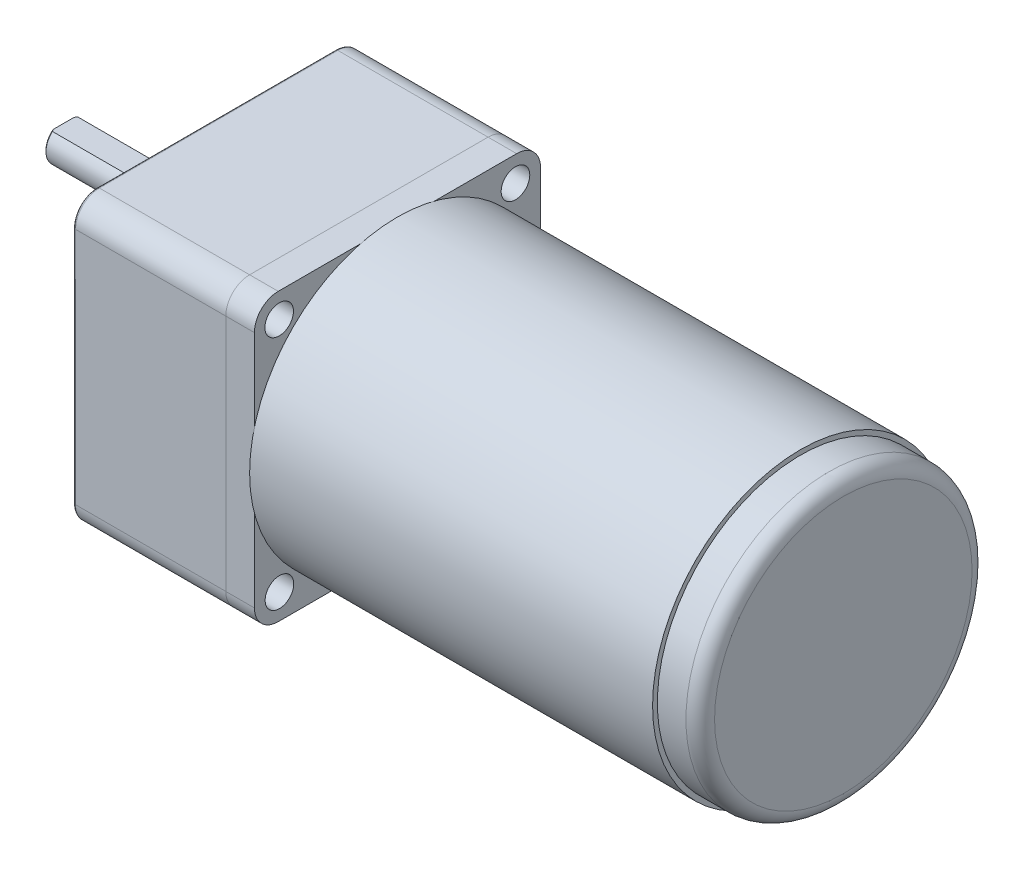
ISO-10303-21;
HEADER;
FILE_DESCRIPTION(('STEP AP214'),'2;1');
FILE_NAME('part.step','',(''),(''),'','','');
FILE_SCHEMA(('AUTOMOTIVE_DESIGN { 1 0 10303 214 1 1 1 1 }'));
ENDSEC;
DATA;
#1=APPLICATION_CONTEXT('core data for automotive mechanical design processes');
#2=APPLICATION_PROTOCOL_DEFINITION('international standard','automotive_design',2000,#1);
#3=PRODUCT_CONTEXT('',#1,'mechanical');
#4=PRODUCT('Part','Part','',(#3));
#5=PRODUCT_RELATED_PRODUCT_CATEGORY('part','',(#4));
#6=PRODUCT_DEFINITION_FORMATION('','',#4);
#7=PRODUCT_DEFINITION_CONTEXT('part definition',#1,'design');
#8=PRODUCT_DEFINITION('design','',#6,#7);
#9=PRODUCT_DEFINITION_SHAPE('','',#8);
#10=(LENGTH_UNIT() NAMED_UNIT(*) SI_UNIT(.MILLI.,.METRE.));
#11=(NAMED_UNIT(*) PLANE_ANGLE_UNIT() SI_UNIT($,.RADIAN.));
#12=(NAMED_UNIT(*) SI_UNIT($,.STERADIAN.) SOLID_ANGLE_UNIT());
#13=UNCERTAINTY_MEASURE_WITH_UNIT(LENGTH_MEASURE(1.E-05),#10,'distance_accuracy_value','');
#14=(GEOMETRIC_REPRESENTATION_CONTEXT(3) GLOBAL_UNCERTAINTY_ASSIGNED_CONTEXT((#13)) GLOBAL_UNIT_ASSIGNED_CONTEXT((#10,
#11,#12)) REPRESENTATION_CONTEXT('',''));
#15=CARTESIAN_POINT('',(0.,0.,0.));
#16=DIRECTION('',(0.,0.,1.));
#17=DIRECTION('',(1.,0.,0.));
#18=AXIS2_PLACEMENT_3D('',#15,#16,#17);
#19=CARTESIAN_POINT('',(131.5,0.,0.));
#20=DIRECTION('',(-1.,0.,0.));
#21=DIRECTION('',(0.,0.,1.));
#22=AXIS2_PLACEMENT_3D('',#19,#20,#21);
#23=CYLINDRICAL_SURFACE('',#22,30.);
#24=CARTESIAN_POINT('',(128.5,0.,0.));
#25=DIRECTION('',(1.,0.,0.));
#26=DIRECTION('',(0.,0.,-1.));
#27=AXIS2_PLACEMENT_3D('',#24,#25,#26);
#28=CIRCLE('',#27,30.);
#29=CARTESIAN_POINT('',(128.5,0.,-30.));
#30=VERTEX_POINT('',#29);
#31=EDGE_CURVE('E11',#30,#30,#28,.F.);
#32=ORIENTED_EDGE('',*,*,#31,.T.);
#33=EDGE_LOOP('',(#32));
#34=FACE_BOUND('',#33,.T.);
#35=CARTESIAN_POINT('',(122.5,0.,0.));
#36=DIRECTION('',(1.,0.,0.));
#37=DIRECTION('',(0.,0.,-1.));
#38=AXIS2_PLACEMENT_3D('',#35,#36,#37);
#39=CIRCLE('',#38,30.);
#40=CARTESIAN_POINT('',(122.5,0.,-30.));
#41=VERTEX_POINT('',#40);
#42=EDGE_CURVE('E55',#41,#41,#39,.T.);
#43=ORIENTED_EDGE('',*,*,#42,.T.);
#44=EDGE_LOOP('',(#43));
#45=FACE_BOUND('',#44,.T.);
#46=ADVANCED_FACE('F44',(#34,#45),#23,.T.);
#47=CARTESIAN_POINT('',(131.5,0.,0.));
#48=DIRECTION('',(1.,0.,0.));
#49=DIRECTION('',(0.,0.,-1.));
#50=AXIS2_PLACEMENT_3D('',#47,#48,#49);
#51=PLANE('',#50);
#52=CARTESIAN_POINT('',(131.5,0.,0.));
#53=DIRECTION('',(1.,0.,0.));
#54=DIRECTION('',(0.,0.,-1.));
#55=AXIS2_PLACEMENT_3D('',#52,#53,#54);
#56=CIRCLE('',#55,27.);
#57=CARTESIAN_POINT('',(131.5,0.,-27.));
#58=VERTEX_POINT('',#57);
#59=EDGE_CURVE('E51',#58,#58,#56,.T.);
#60=ORIENTED_EDGE('',*,*,#59,.T.);
#61=EDGE_LOOP('',(#60));
#62=FACE_BOUND('',#61,.T.);
#63=ADVANCED_FACE('F65',(#62),#51,.T.);
#64=CARTESIAN_POINT('',(122.5,0.,0.));
#65=DIRECTION('',(1.,0.,0.));
#66=DIRECTION('',(0.,0.,-1.));
#67=AXIS2_PLACEMENT_3D('',#64,#65,#66);
#68=PLANE('',#67);
#69=ORIENTED_EDGE('',*,*,#42,.F.);
#70=EDGE_LOOP('',(#69));
#71=FACE_BOUND('',#70,.T.);
#72=ADVANCED_FACE('F63',(#71),#68,.F.);
#73=CARTESIAN_POINT('',(128.5,0.,0.));
#74=DIRECTION('',(1.,0.,0.));
#75=DIRECTION('',(0.,0.,-1.));
#76=AXIS2_PLACEMENT_3D('',#73,#74,#75);
#77=TOROIDAL_SURFACE('',#76,27.,3.);
#78=ORIENTED_EDGE('',*,*,#31,.F.);
#79=EDGE_LOOP('',(#78));
#80=FACE_BOUND('',#79,.T.);
#81=ORIENTED_EDGE('',*,*,#59,.F.);
#82=EDGE_LOOP('',(#81));
#83=FACE_BOUND('',#82,.T.);
#84=ADVANCED_FACE('F46',(#80,#83),#77,.T.);
#85=CLOSED_SHELL('',(#46,#63,#72,#84));
#86=MANIFOLD_SOLID_BREP('B2',#85);
#87=CARTESIAN_POINT('',(122.5,0.,0.));
#88=DIRECTION('',(-1.,0.,0.));
#89=DIRECTION('',(0.,0.,1.));
#90=AXIS2_PLACEMENT_3D('',#87,#88,#89);
#91=CYLINDRICAL_SURFACE('',#90,31.);
#92=CARTESIAN_POINT('',(122.5,0.,0.));
#93=DIRECTION('',(1.,0.,0.));
#94=DIRECTION('',(0.,0.,-1.));
#95=AXIS2_PLACEMENT_3D('',#92,#93,#94);
#96=CIRCLE('',#95,31.);
#97=CARTESIAN_POINT('',(122.5,0.,-31.));
#98=VERTEX_POINT('',#97);
#99=EDGE_CURVE('E43',#98,#98,#96,.T.);
#100=ORIENTED_EDGE('',*,*,#99,.F.);
#101=EDGE_LOOP('',(#100));
#102=FACE_BOUND('',#101,.T.);
#103=CARTESIAN_POINT('',(38.,0.,0.));
#104=DIRECTION('',(1.,0.,0.));
#105=DIRECTION('',(0.,0.,-1.));
#106=AXIS2_PLACEMENT_3D('',#103,#104,#105);
#107=CIRCLE('',#106,31.);
#108=CARTESIAN_POINT('',(38.,0.,-31.));
#109=VERTEX_POINT('',#108);
#110=EDGE_CURVE('E113',#109,#109,#107,.T.);
#111=ORIENTED_EDGE('',*,*,#110,.T.);
#112=EDGE_LOOP('',(#111));
#113=FACE_BOUND('',#112,.T.);
#114=ADVANCED_FACE('F110',(#102,#113),#91,.T.);
#115=CARTESIAN_POINT('',(122.5,0.,0.));
#116=DIRECTION('',(1.,0.,0.));
#117=DIRECTION('',(0.,0.,-1.));
#118=AXIS2_PLACEMENT_3D('',#115,#116,#117);
#119=PLANE('',#118);
#120=ORIENTED_EDGE('',*,*,#99,.T.);
#121=EDGE_LOOP('',(#120));
#122=FACE_BOUND('',#121,.T.);
#123=ADVANCED_FACE('F125',(#122),#119,.T.);
#124=CARTESIAN_POINT('',(38.,0.,0.));
#125=DIRECTION('',(1.,0.,0.));
#126=DIRECTION('',(0.,0.,-1.));
#127=AXIS2_PLACEMENT_3D('',#124,#125,#126);
#128=PLANE('',#127);
#129=ORIENTED_EDGE('',*,*,#110,.F.);
#130=EDGE_LOOP('',(#129));
#131=FACE_BOUND('',#130,.T.);
#132=ADVANCED_FACE('F123',(#131),#128,.F.);
#133=CLOSED_SHELL('',(#114,#123,#132));
#134=MANIFOLD_SOLID_BREP('B6',#133);
#135=CARTESIAN_POINT('',(-32.,10.,0.));
#136=DIRECTION('',(1.,0.,0.));
#137=DIRECTION('',(0.,0.,-1.));
#138=AXIS2_PLACEMENT_3D('',#135,#136,#137);
#139=CYLINDRICAL_SURFACE('',#138,4.);
#140=DIRECTION('',(-1.,0.,0.));
#141=VECTOR('',#140,1.);
#142=CARTESIAN_POINT('',(-7.,13.,2.64575131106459));
#143=LINE('',#142,#141);
#144=CARTESIAN_POINT('',(-7.,13.,2.64575131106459));
#145=VERTEX_POINT('',#144);
#146=CARTESIAN_POINT('',(-31.7,13.,2.64575131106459));
#147=VERTEX_POINT('',#146);
#148=EDGE_CURVE('E202',#145,#147,#143,.T.);
#149=ORIENTED_EDGE('',*,*,#148,.T.);
#150=CARTESIAN_POINT('',(-31.7,10.,0.));
#151=DIRECTION('',(-1.,0.,0.));
#152=DIRECTION('',(0.,0.,1.));
#153=AXIS2_PLACEMENT_3D('',#150,#151,#152);
#154=CIRCLE('',#153,4.);
#155=CARTESIAN_POINT('',(-31.7,13.,-2.64575131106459));
#156=VERTEX_POINT('',#155);
#157=EDGE_CURVE('E108',#147,#156,#154,.F.);
#158=ORIENTED_EDGE('',*,*,#157,.T.);
#159=DIRECTION('',(-1.,0.,0.));
#160=VECTOR('',#159,1.);
#161=CARTESIAN_POINT('',(-7.,13.,-2.64575131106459));
#162=LINE('',#161,#160);
#163=CARTESIAN_POINT('',(-7.,13.,-2.64575131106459));
#164=VERTEX_POINT('',#163);
#165=EDGE_CURVE('E200',#164,#156,#162,.T.);
#166=ORIENTED_EDGE('',*,*,#165,.F.);
#167=CARTESIAN_POINT('',(-7.,10.,0.));
#168=DIRECTION('',(-1.,0.,0.));
#169=DIRECTION('',(0.,0.,1.));
#170=AXIS2_PLACEMENT_3D('',#167,#168,#169);
#171=CIRCLE('',#170,4.);
#172=EDGE_CURVE('E193',#145,#164,#171,.T.);
#173=ORIENTED_EDGE('',*,*,#172,.F.);
#174=EDGE_LOOP('',(#149,#158,#166,#173));
#175=FACE_BOUND('',#174,.T.);
#176=CARTESIAN_POINT('',(-3.,10.,0.));
#177=DIRECTION('',(-1.,0.,0.));
#178=DIRECTION('',(0.,0.,1.));
#179=AXIS2_PLACEMENT_3D('',#176,#177,#178);
#180=CIRCLE('',#179,4.);
#181=CARTESIAN_POINT('',(-3.,10.,4.));
#182=VERTEX_POINT('',#181);
#183=EDGE_CURVE('E206',#182,#182,#180,.T.);
#184=ORIENTED_EDGE('',*,*,#183,.T.);
#185=EDGE_LOOP('',(#184));
#186=FACE_BOUND('',#185,.T.);
#187=ADVANCED_FACE('F159',(#175,#186),#139,.T.);
#188=CARTESIAN_POINT('',(-32.,10.,0.));
#189=DIRECTION('',(-1.,0.,0.));
#190=DIRECTION('',(0.,0.,1.));
#191=AXIS2_PLACEMENT_3D('',#188,#189,#190);
#192=PLANE('',#191);
#193=DIRECTION('',(0.,0.,1.));
#194=VECTOR('',#193,1.);
#195=CARTESIAN_POINT('',(-32.,13.,2.64575131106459));
#196=LINE('',#195,#194);
#197=CARTESIAN_POINT('',(-32.,13.,-2.16564078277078));
#198=VERTEX_POINT('',#197);
#199=CARTESIAN_POINT('',(-32.,13.,2.16564078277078));
#200=VERTEX_POINT('',#199);
#201=EDGE_CURVE('E197',#198,#200,#196,.T.);
#202=ORIENTED_EDGE('',*,*,#201,.F.);
#203=CARTESIAN_POINT('',(-32.,10.,0.));
#204=DIRECTION('',(-1.,0.,0.));
#205=DIRECTION('',(0.,0.,1.));
#206=AXIS2_PLACEMENT_3D('',#203,#204,#205);
#207=CIRCLE('',#206,3.70000000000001);
#208=EDGE_CURVE('E212',#198,#200,#207,.T.);
#209=ORIENTED_EDGE('',*,*,#208,.T.);
#210=EDGE_LOOP('',(#202,#209));
#211=FACE_BOUND('',#210,.T.);
#212=ADVANCED_FACE('F228',(#211),#192,.T.);
#213=CARTESIAN_POINT('',(-3.,10.,0.));
#214=DIRECTION('',(-1.,0.,0.));
#215=DIRECTION('',(0.,0.,1.));
#216=AXIS2_PLACEMENT_3D('',#213,#214,#215);
#217=PLANE('',#216);
#218=ORIENTED_EDGE('',*,*,#183,.F.);
#219=EDGE_LOOP('',(#218));
#220=FACE_BOUND('',#219,.T.);
#221=ADVANCED_FACE('F227',(#220),#217,.F.);
#222=CARTESIAN_POINT('',(-7.,13.,2.64575131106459));
#223=DIRECTION('',(0.,-1.,0.));
#224=DIRECTION('',(0.,0.,-1.));
#225=AXIS2_PLACEMENT_3D('',#222,#223,#224);
#226=PLANE('',#225);
#227=ORIENTED_EDGE('',*,*,#201,.T.);
#228=CARTESIAN_POINT('',(-32.,13.,2.16564078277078));
#229=CARTESIAN_POINT('',(-31.9761619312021,13.,2.20636622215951));
#230=CARTESIAN_POINT('',(-31.95199678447,13.,2.2468991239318));
#231=CARTESIAN_POINT('',(-31.9030718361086,13.,2.32759423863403));
#232=CARTESIAN_POINT('',(-31.8783121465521,13.,2.36775651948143));
#233=CARTESIAN_POINT('',(-31.8282492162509,13.,2.44773910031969));
#234=CARTESIAN_POINT('',(-31.80294598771,13.,2.48755940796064));
#235=CARTESIAN_POINT('',(-31.7518371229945,13.,2.56688695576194));
#236=CARTESIAN_POINT('',(-31.7260313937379,13.,2.60639413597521));
#237=CARTESIAN_POINT('',(-31.7000000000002,13.,2.64575131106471));
#238=B_SPLINE_CURVE_WITH_KNOTS('',3,(#228,#229,#230,#231,#232,#233,#234,#235,#236,#237),
.UNSPECIFIED.,.F.,.F.,(4,2,2,2,4),(0.,0.141564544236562,0.28310260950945,0.424637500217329,
0.566198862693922),.UNSPECIFIED.);
#239=EDGE_CURVE('E168',#200,#147,#238,.T.);
#240=ORIENTED_EDGE('',*,*,#239,.T.);
#241=ORIENTED_EDGE('',*,*,#148,.F.);
#242=DIRECTION('',(0.,0.,1.));
#243=VECTOR('',#242,1.);
#244=CARTESIAN_POINT('',(-7.,13.,2.64575131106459));
#245=LINE('',#244,#243);
#246=EDGE_CURVE('E196',#164,#145,#245,.T.);
#247=ORIENTED_EDGE('',*,*,#246,.F.);
#248=ORIENTED_EDGE('',*,*,#165,.T.);
#249=CARTESIAN_POINT('',(-31.7,13.,-2.64575131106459));
#250=CARTESIAN_POINT('',(-31.7260313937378,13.,-2.60639413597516));
#251=CARTESIAN_POINT('',(-31.7518371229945,13.,-2.56688695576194));
#252=CARTESIAN_POINT('',(-31.80294598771,13.,-2.48755940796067));
#253=CARTESIAN_POINT('',(-31.8282492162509,13.,-2.44773910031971));
#254=CARTESIAN_POINT('',(-31.878312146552,13.,-2.36775651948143));
#255=CARTESIAN_POINT('',(-31.9030718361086,13.,-2.32759423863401));
#256=CARTESIAN_POINT('',(-31.9519967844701,13.,-2.24689912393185));
#257=CARTESIAN_POINT('',(-31.9761619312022,13.,-2.20636622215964));
#258=CARTESIAN_POINT('',(-32.0000000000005,13.,-2.16564078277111));
#259=B_SPLINE_CURVE_WITH_KNOTS('',3,(#249,#250,#251,#252,#253,#254,#255,#256,#257,#258),
.UNSPECIFIED.,.F.,.F.,(4,2,2,2,4),(0.,0.141561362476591,0.283096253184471,0.424634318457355,
0.566198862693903),.UNSPECIFIED.);
#260=EDGE_CURVE('E215',#156,#198,#259,.T.);
#261=ORIENTED_EDGE('',*,*,#260,.T.);
#262=EDGE_LOOP('',(#227,#240,#241,#247,#248,#261));
#263=FACE_BOUND('',#262,.T.);
#264=ADVANCED_FACE('F199',(#263),#226,.F.);
#265=CARTESIAN_POINT('',(-7.,10.,0.));
#266=DIRECTION('',(-1.,0.,0.));
#267=DIRECTION('',(0.,0.,1.));
#268=AXIS2_PLACEMENT_3D('',#265,#266,#267);
#269=PLANE('',#268);
#270=ORIENTED_EDGE('',*,*,#172,.T.);
#271=ORIENTED_EDGE('',*,*,#246,.T.);
#272=EDGE_LOOP('',(#270,#271));
#273=FACE_BOUND('',#272,.T.);
#274=ADVANCED_FACE('F195',(#273),#269,.T.);
#275=CARTESIAN_POINT('',(-32.,10.,0.));
#276=DIRECTION('',(1.,0.,0.));
#277=DIRECTION('',(0.,0.,-1.));
#278=AXIS2_PLACEMENT_3D('',#275,#276,#277);
#279=CONICAL_SURFACE('',#278,3.70000000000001,0.785398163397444);
#280=ORIENTED_EDGE('',*,*,#260,.F.);
#281=ORIENTED_EDGE('',*,*,#157,.F.);
#282=ORIENTED_EDGE('',*,*,#239,.F.);
#283=ORIENTED_EDGE('',*,*,#208,.F.);
#284=EDGE_LOOP('',(#280,#281,#282,#283));
#285=FACE_BOUND('',#284,.T.);
#286=ADVANCED_FACE('F161',(#285),#279,.T.);
#287=CLOSED_SHELL('',(#187,#212,#221,#264,#274,#286));
#288=MANIFOLD_SOLID_BREP('B38',#287);
#289=CARTESIAN_POINT('',(-3.,10.,0.));
#290=DIRECTION('',(1.,0.,0.));
#291=DIRECTION('',(0.,0.,-1.));
#292=AXIS2_PLACEMENT_3D('',#289,#290,#291);
#293=CYLINDRICAL_SURFACE('',#292,12.);
#294=CARTESIAN_POINT('',(-2.5,10.,0.));
#295=DIRECTION('',(-1.,0.,0.));
#296=DIRECTION('',(0.,0.,1.));
#297=AXIS2_PLACEMENT_3D('',#294,#295,#296);
#298=CIRCLE('',#297,12.);
#299=CARTESIAN_POINT('',(-2.5,10.,12.));
#300=VERTEX_POINT('',#299);
#301=EDGE_CURVE('E158',#300,#300,#298,.F.);
#302=ORIENTED_EDGE('',*,*,#301,.T.);
#303=EDGE_LOOP('',(#302));
#304=FACE_BOUND('',#303,.T.);
#305=CARTESIAN_POINT('',(0.,10.,0.));
#306=DIRECTION('',(-1.,0.,0.));
#307=DIRECTION('',(0.,0.,1.));
#308=AXIS2_PLACEMENT_3D('',#305,#306,#307);
#309=CIRCLE('',#308,12.);
#310=CARTESIAN_POINT('',(0.,10.,12.));
#311=VERTEX_POINT('',#310);
#312=EDGE_CURVE('E303',#311,#311,#309,.T.);
#313=ORIENTED_EDGE('',*,*,#312,.T.);
#314=EDGE_LOOP('',(#313));
#315=FACE_BOUND('',#314,.T.);
#316=ADVANCED_FACE('F292',(#304,#315),#293,.T.);
#317=CARTESIAN_POINT('',(-3.,10.,0.));
#318=DIRECTION('',(-1.,0.,0.));
#319=DIRECTION('',(0.,0.,1.));
#320=AXIS2_PLACEMENT_3D('',#317,#318,#319);
#321=PLANE('',#320);
#322=CARTESIAN_POINT('',(-3.,10.,0.));
#323=DIRECTION('',(-1.,0.,0.));
#324=DIRECTION('',(0.,0.,1.));
#325=AXIS2_PLACEMENT_3D('',#322,#323,#324);
#326=CIRCLE('',#325,11.5);
#327=CARTESIAN_POINT('',(-3.,10.,11.5));
#328=VERTEX_POINT('',#327);
#329=EDGE_CURVE('E299',#328,#328,#326,.T.);
#330=ORIENTED_EDGE('',*,*,#329,.T.);
#331=EDGE_LOOP('',(#330));
#332=FACE_BOUND('',#331,.T.);
#333=ADVANCED_FACE('F313',(#332),#321,.T.);
#334=CARTESIAN_POINT('',(0.,10.,0.));
#335=DIRECTION('',(-1.,0.,0.));
#336=DIRECTION('',(0.,0.,1.));
#337=AXIS2_PLACEMENT_3D('',#334,#335,#336);
#338=PLANE('',#337);
#339=ORIENTED_EDGE('',*,*,#312,.F.);
#340=EDGE_LOOP('',(#339));
#341=FACE_BOUND('',#340,.T.);
#342=ADVANCED_FACE('F311',(#341),#338,.F.);
#343=CARTESIAN_POINT('',(-2.5,10.,0.));
#344=DIRECTION('',(-1.,0.,0.));
#345=DIRECTION('',(0.,0.,1.));
#346=AXIS2_PLACEMENT_3D('',#343,#344,#345);
#347=TOROIDAL_SURFACE('',#346,11.5,0.5);
#348=ORIENTED_EDGE('',*,*,#301,.F.);
#349=EDGE_LOOP('',(#348));
#350=FACE_BOUND('',#349,.T.);
#351=ORIENTED_EDGE('',*,*,#329,.F.);
#352=EDGE_LOOP('',(#351));
#353=FACE_BOUND('',#352,.T.);
#354=ADVANCED_FACE('F294',(#350,#353),#347,.T.);
#355=CLOSED_SHELL('',(#316,#333,#342,#354));
#356=MANIFOLD_SOLID_BREP('B102',#355);
#357=CARTESIAN_POINT('',(38.,25.,-25.));
#358=DIRECTION('',(-1.,0.,0.));
#359=DIRECTION('',(0.,0.,1.));
#360=AXIS2_PLACEMENT_3D('',#357,#358,#359);
#361=CYLINDRICAL_SURFACE('',#360,5.);
#362=CARTESIAN_POINT('',(32.,25.,-25.));
#363=DIRECTION('',(1.,0.,0.));
#364=DIRECTION('',(0.,0.,1.));
#365=AXIS2_PLACEMENT_3D('',#362,#363,#364);
#366=CIRCLE('',#365,5.);
#367=CARTESIAN_POINT('',(32.,25.,-30.));
#368=VERTEX_POINT('',#367);
#369=CARTESIAN_POINT('',(32.,30.,-25.));
#370=VERTEX_POINT('',#369);
#371=EDGE_CURVE('E455',#368,#370,#366,.T.);
#372=ORIENTED_EDGE('',*,*,#371,.T.);
#373=DIRECTION('',(-1.,0.,0.));
#374=VECTOR('',#373,1.);
#375=CARTESIAN_POINT('',(38.,30.,-25.));
#376=LINE('',#375,#374);
#377=CARTESIAN_POINT('',(38.,30.,-25.));
#378=VERTEX_POINT('',#377);
#379=EDGE_CURVE('E290',#378,#370,#376,.T.);
#380=ORIENTED_EDGE('',*,*,#379,.F.);
#381=CARTESIAN_POINT('',(38.,25.,-25.));
#382=DIRECTION('',(1.,0.,0.));
#383=DIRECTION('',(0.,0.,1.));
#384=AXIS2_PLACEMENT_3D('',#381,#382,#383);
#385=CIRCLE('',#384,5.);
#386=CARTESIAN_POINT('',(38.,25.,-30.));
#387=VERTEX_POINT('',#386);
#388=EDGE_CURVE('E469',#387,#378,#385,.T.);
#389=ORIENTED_EDGE('',*,*,#388,.F.);
#390=DIRECTION('',(-1.,0.,0.));
#391=VECTOR('',#390,1.);
#392=CARTESIAN_POINT('',(38.,25.,-30.));
#393=LINE('',#392,#391);
#394=EDGE_CURVE('E451',#387,#368,#393,.T.);
#395=ORIENTED_EDGE('',*,*,#394,.T.);
#396=EDGE_LOOP('',(#372,#380,#389,#395));
#397=FACE_BOUND('',#396,.T.);
#398=ADVANCED_FACE('F357',(#397),#361,.T.);
#399=CARTESIAN_POINT('',(38.,30.,25.));
#400=DIRECTION('',(0.,-1.,0.));
#401=DIRECTION('',(0.,0.,-1.));
#402=AXIS2_PLACEMENT_3D('',#399,#400,#401);
#403=PLANE('',#402);
#404=DIRECTION('',(0.,0.,1.));
#405=VECTOR('',#404,1.);
#406=CARTESIAN_POINT('',(32.,30.,25.));
#407=LINE('',#406,#405);
#408=CARTESIAN_POINT('',(32.,30.,25.));
#409=VERTEX_POINT('',#408);
#410=EDGE_CURVE('E458',#370,#409,#407,.T.);
#411=ORIENTED_EDGE('',*,*,#410,.T.);
#412=DIRECTION('',(-1.,0.,0.));
#413=VECTOR('',#412,1.);
#414=CARTESIAN_POINT('',(38.,30.,25.));
#415=LINE('',#414,#413);
#416=CARTESIAN_POINT('',(38.,30.,25.));
#417=VERTEX_POINT('',#416);
#418=EDGE_CURVE('E366',#417,#409,#415,.T.);
#419=ORIENTED_EDGE('',*,*,#418,.F.);
#420=DIRECTION('',(0.,0.,1.));
#421=VECTOR('',#420,1.);
#422=CARTESIAN_POINT('',(38.,30.,25.));
#423=LINE('',#422,#421);
#424=EDGE_CURVE('E418',#378,#417,#423,.T.);
#425=ORIENTED_EDGE('',*,*,#424,.F.);
#426=ORIENTED_EDGE('',*,*,#379,.T.);
#427=EDGE_LOOP('',(#411,#419,#425,#426));
#428=FACE_BOUND('',#427,.T.);
#429=ADVANCED_FACE('F523',(#428),#403,.F.);
#430=CARTESIAN_POINT('',(38.,25.,25.));
#431=DIRECTION('',(-1.,0.,0.));
#432=DIRECTION('',(0.,0.,1.));
#433=AXIS2_PLACEMENT_3D('',#430,#431,#432);
#434=CYLINDRICAL_SURFACE('',#433,5.);
#435=CARTESIAN_POINT('',(32.,25.,25.));
#436=DIRECTION('',(1.,0.,0.));
#437=DIRECTION('',(0.,0.,1.));
#438=AXIS2_PLACEMENT_3D('',#435,#436,#437);
#439=CIRCLE('',#438,5.);
#440=CARTESIAN_POINT('',(32.,25.,30.));
#441=VERTEX_POINT('',#440);
#442=EDGE_CURVE('E460',#409,#441,#439,.T.);
#443=ORIENTED_EDGE('',*,*,#442,.T.);
#444=DIRECTION('',(-1.,0.,0.));
#445=VECTOR('',#444,1.);
#446=CARTESIAN_POINT('',(38.,25.,30.));
#447=LINE('',#446,#445);
#448=CARTESIAN_POINT('',(38.,25.,30.));
#449=VERTEX_POINT('',#448);
#450=EDGE_CURVE('E476',#449,#441,#447,.T.);
#451=ORIENTED_EDGE('',*,*,#450,.F.);
#452=CARTESIAN_POINT('',(38.,25.,25.));
#453=DIRECTION('',(1.,0.,0.));
#454=DIRECTION('',(0.,0.,1.));
#455=AXIS2_PLACEMENT_3D('',#452,#453,#454);
#456=CIRCLE('',#455,5.);
#457=EDGE_CURVE('E624',#417,#449,#456,.T.);
#458=ORIENTED_EDGE('',*,*,#457,.F.);
#459=ORIENTED_EDGE('',*,*,#418,.T.);
#460=EDGE_LOOP('',(#443,#451,#458,#459));
#461=FACE_BOUND('',#460,.T.);
#462=ADVANCED_FACE('F527',(#461),#434,.T.);
#463=CARTESIAN_POINT('',(38.,-25.,30.));
#464=DIRECTION('',(0.,0.,-1.));
#465=DIRECTION('',(-1.,0.,0.));
#466=AXIS2_PLACEMENT_3D('',#463,#464,#465);
#467=PLANE('',#466);
#468=DIRECTION('',(0.,-1.,0.));
#469=VECTOR('',#468,1.);
#470=CARTESIAN_POINT('',(32.,-25.,30.));
#471=LINE('',#470,#469);
#472=CARTESIAN_POINT('',(32.,-25.,30.));
#473=VERTEX_POINT('',#472);
#474=EDGE_CURVE('E462',#441,#473,#471,.T.);
#475=ORIENTED_EDGE('',*,*,#474,.T.);
#476=DIRECTION('',(-1.,0.,0.));
#477=VECTOR('',#476,1.);
#478=CARTESIAN_POINT('',(38.,-25.,30.));
#479=LINE('',#478,#477);
#480=CARTESIAN_POINT('',(38.,-25.,30.));
#481=VERTEX_POINT('',#480);
#482=EDGE_CURVE('E473',#481,#473,#479,.T.);
#483=ORIENTED_EDGE('',*,*,#482,.F.);
#484=DIRECTION('',(0.,-1.,0.));
#485=VECTOR('',#484,1.);
#486=CARTESIAN_POINT('',(38.,-25.,30.));
#487=LINE('',#486,#485);
#488=EDGE_CURVE('E626',#449,#481,#487,.T.);
#489=ORIENTED_EDGE('',*,*,#488,.F.);
#490=ORIENTED_EDGE('',*,*,#450,.T.);
#491=EDGE_LOOP('',(#475,#483,#489,#490));
#492=FACE_BOUND('',#491,.T.);
#493=ADVANCED_FACE('F531',(#492),#467,.F.);
#494=CARTESIAN_POINT('',(38.,-25.,25.));
#495=DIRECTION('',(-1.,0.,0.));
#496=DIRECTION('',(0.,0.,1.));
#497=AXIS2_PLACEMENT_3D('',#494,#495,#496);
#498=CYLINDRICAL_SURFACE('',#497,5.);
#499=CARTESIAN_POINT('',(32.,-25.,25.));
#500=DIRECTION('',(1.,0.,0.));
#501=DIRECTION('',(0.,0.,1.));
#502=AXIS2_PLACEMENT_3D('',#499,#500,#501);
#503=CIRCLE('',#502,5.);
#504=CARTESIAN_POINT('',(32.,-30.,25.));
#505=VERTEX_POINT('',#504);
#506=EDGE_CURVE('E464',#473,#505,#503,.T.);
#507=ORIENTED_EDGE('',*,*,#506,.T.);
#508=DIRECTION('',(-1.,0.,0.));
#509=VECTOR('',#508,1.);
#510=CARTESIAN_POINT('',(38.,-30.,25.));
#511=LINE('',#510,#509);
#512=CARTESIAN_POINT('',(38.,-30.,25.));
#513=VERTEX_POINT('',#512);
#514=EDGE_CURVE('E446',#513,#505,#511,.T.);
#515=ORIENTED_EDGE('',*,*,#514,.F.);
#516=CARTESIAN_POINT('',(38.,-25.,25.));
#517=DIRECTION('',(1.,0.,0.));
#518=DIRECTION('',(0.,0.,1.));
#519=AXIS2_PLACEMENT_3D('',#516,#517,#518);
#520=CIRCLE('',#519,5.);
#521=EDGE_CURVE('E437',#481,#513,#520,.T.);
#522=ORIENTED_EDGE('',*,*,#521,.F.);
#523=ORIENTED_EDGE('',*,*,#482,.T.);
#524=EDGE_LOOP('',(#507,#515,#522,#523));
#525=FACE_BOUND('',#524,.T.);
#526=ADVANCED_FACE('F537',(#525),#498,.T.);
#527=CARTESIAN_POINT('',(38.,-30.,25.));
#528=DIRECTION('',(0.,1.,0.));
#529=DIRECTION('',(0.,0.,1.));
#530=AXIS2_PLACEMENT_3D('',#527,#528,#529);
#531=PLANE('',#530);
#532=DIRECTION('',(0.,0.,-1.));
#533=VECTOR('',#532,1.);
#534=CARTESIAN_POINT('',(32.,-30.,25.));
#535=LINE('',#534,#533);
#536=CARTESIAN_POINT('',(32.,-30.,-25.));
#537=VERTEX_POINT('',#536);
#538=EDGE_CURVE('E445',#505,#537,#535,.T.);
#539=ORIENTED_EDGE('',*,*,#538,.T.);
#540=DIRECTION('',(-1.,0.,0.));
#541=VECTOR('',#540,1.);
#542=CARTESIAN_POINT('',(38.,-30.,-25.));
#543=LINE('',#542,#541);
#544=CARTESIAN_POINT('',(38.,-30.,-25.));
#545=VERTEX_POINT('',#544);
#546=EDGE_CURVE('E442',#545,#537,#543,.T.);
#547=ORIENTED_EDGE('',*,*,#546,.F.);
#548=DIRECTION('',(0.,0.,-1.));
#549=VECTOR('',#548,1.);
#550=CARTESIAN_POINT('',(38.,-30.,25.));
#551=LINE('',#550,#549);
#552=EDGE_CURVE('E431',#513,#545,#551,.T.);
#553=ORIENTED_EDGE('',*,*,#552,.F.);
#554=ORIENTED_EDGE('',*,*,#514,.T.);
#555=EDGE_LOOP('',(#539,#547,#553,#554));
#556=FACE_BOUND('',#555,.T.);
#557=ADVANCED_FACE('F443',(#556),#531,.F.);
#558=CARTESIAN_POINT('',(38.,-25.,-25.));
#559=DIRECTION('',(-1.,0.,0.));
#560=DIRECTION('',(0.,0.,1.));
#561=AXIS2_PLACEMENT_3D('',#558,#559,#560);
#562=CYLINDRICAL_SURFACE('',#561,5.);
#563=CARTESIAN_POINT('',(32.,-25.,-25.));
#564=DIRECTION('',(1.,0.,0.));
#565=DIRECTION('',(0.,0.,-1.));
#566=AXIS2_PLACEMENT_3D('',#563,#564,#565);
#567=CIRCLE('',#566,5.);
#568=CARTESIAN_POINT('',(32.,-25.,-30.));
#569=VERTEX_POINT('',#568);
#570=EDGE_CURVE('E404',#537,#569,#567,.T.);
#571=ORIENTED_EDGE('',*,*,#570,.T.);
#572=DIRECTION('',(-1.,0.,0.));
#573=VECTOR('',#572,1.);
#574=CARTESIAN_POINT('',(38.,-25.,-30.));
#575=LINE('',#574,#573);
#576=CARTESIAN_POINT('',(38.,-25.,-30.));
#577=VERTEX_POINT('',#576);
#578=EDGE_CURVE('E447',#577,#569,#575,.T.);
#579=ORIENTED_EDGE('',*,*,#578,.F.);
#580=CARTESIAN_POINT('',(38.,-25.,-25.));
#581=DIRECTION('',(1.,0.,0.));
#582=DIRECTION('',(0.,0.,-1.));
#583=AXIS2_PLACEMENT_3D('',#580,#581,#582);
#584=CIRCLE('',#583,5.);
#585=EDGE_CURVE('E435',#545,#577,#584,.T.);
#586=ORIENTED_EDGE('',*,*,#585,.F.);
#587=ORIENTED_EDGE('',*,*,#546,.T.);
#588=EDGE_LOOP('',(#571,#579,#586,#587));
#589=FACE_BOUND('',#588,.T.);
#590=ADVANCED_FACE('F449',(#589),#562,.T.);
#591=CARTESIAN_POINT('',(38.,-25.,-30.));
#592=DIRECTION('',(0.,0.,1.));
#593=DIRECTION('',(1.,0.,0.));
#594=AXIS2_PLACEMENT_3D('',#591,#592,#593);
#595=PLANE('',#594);
#596=DIRECTION('',(0.,1.,0.));
#597=VECTOR('',#596,1.);
#598=CARTESIAN_POINT('',(32.,-25.,-30.));
#599=LINE('',#598,#597);
#600=EDGE_CURVE('E410',#569,#368,#599,.T.);
#601=ORIENTED_EDGE('',*,*,#600,.T.);
#602=ORIENTED_EDGE('',*,*,#394,.F.);
#603=DIRECTION('',(0.,1.,0.));
#604=VECTOR('',#603,1.);
#605=CARTESIAN_POINT('',(38.,-25.,-30.));
#606=LINE('',#605,#604);
#607=EDGE_CURVE('E375',#577,#387,#606,.T.);
#608=ORIENTED_EDGE('',*,*,#607,.F.);
#609=ORIENTED_EDGE('',*,*,#578,.T.);
#610=EDGE_LOOP('',(#601,#602,#608,#609));
#611=FACE_BOUND('',#610,.T.);
#612=ADVANCED_FACE('F512',(#611),#595,.F.);
#613=CARTESIAN_POINT('',(38.,25.,-25.));
#614=DIRECTION('',(-1.,0.,0.));
#615=DIRECTION('',(0.,0.,1.));
#616=AXIS2_PLACEMENT_3D('',#613,#614,#615);
#617=PLANE('',#616);
#618=CARTESIAN_POINT('',(38.,24.8007290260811,24.8007290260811));
#619=DIRECTION('',(1.,0.,0.));
#620=DIRECTION('',(0.,0.,-1.));
#621=AXIS2_PLACEMENT_3D('',#618,#619,#620);
#622=CIRCLE('',#621,3.);
#623=CARTESIAN_POINT('',(38.,24.8007290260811,21.8007290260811));
#624=VERTEX_POINT('',#623);
#625=EDGE_CURVE('E485',#624,#624,#622,.T.);
#626=ORIENTED_EDGE('',*,*,#625,.F.);
#627=EDGE_LOOP('',(#626));
#628=FACE_BOUND('',#627,.T.);
#629=CARTESIAN_POINT('',(38.,24.7487373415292,-24.7487373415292));
#630=DIRECTION('',(1.,0.,0.));
#631=DIRECTION('',(0.,0.,-1.));
#632=AXIS2_PLACEMENT_3D('',#629,#630,#631);
#633=CIRCLE('',#632,3.);
#634=CARTESIAN_POINT('',(38.,24.7487373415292,-27.7487373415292));
#635=VERTEX_POINT('',#634);
#636=EDGE_CURVE('E610',#635,#635,#633,.T.);
#637=ORIENTED_EDGE('',*,*,#636,.F.);
#638=EDGE_LOOP('',(#637));
#639=FACE_BOUND('',#638,.T.);
#640=CARTESIAN_POINT('',(38.,-24.7487373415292,-24.7487373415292));
#641=DIRECTION('',(1.,0.,0.));
#642=DIRECTION('',(0.,0.,-1.));
#643=AXIS2_PLACEMENT_3D('',#640,#641,#642);
#644=CIRCLE('',#643,3.);
#645=CARTESIAN_POINT('',(38.,-24.7487373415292,-27.7487373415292));
#646=VERTEX_POINT('',#645);
#647=EDGE_CURVE('E612',#646,#646,#644,.T.);
#648=ORIENTED_EDGE('',*,*,#647,.F.);
#649=EDGE_LOOP('',(#648));
#650=FACE_BOUND('',#649,.T.);
#651=CARTESIAN_POINT('',(38.,-24.7487373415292,24.7487373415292));
#652=DIRECTION('',(1.,0.,0.));
#653=DIRECTION('',(0.,0.,-1.));
#654=AXIS2_PLACEMENT_3D('',#651,#652,#653);
#655=CIRCLE('',#654,3.);
#656=CARTESIAN_POINT('',(38.,-24.7487373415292,21.7487373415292));
#657=VERTEX_POINT('',#656);
#658=EDGE_CURVE('E617',#657,#657,#655,.T.);
#659=ORIENTED_EDGE('',*,*,#658,.F.);
#660=EDGE_LOOP('',(#659));
#661=FACE_BOUND('',#660,.T.);
#662=ORIENTED_EDGE('',*,*,#388,.T.);
#663=ORIENTED_EDGE('',*,*,#424,.T.);
#664=ORIENTED_EDGE('',*,*,#457,.T.);
#665=ORIENTED_EDGE('',*,*,#488,.T.);
#666=ORIENTED_EDGE('',*,*,#521,.T.);
#667=ORIENTED_EDGE('',*,*,#552,.T.);
#668=ORIENTED_EDGE('',*,*,#585,.T.);
#669=ORIENTED_EDGE('',*,*,#607,.T.);
#670=EDGE_LOOP('',(#662,#663,#664,#665,#666,#667,#668,#669));
#671=FACE_BOUND('',#670,.T.);
#672=ADVANCED_FACE('F433',(#628,#639,#650,#661,#671),#617,.F.);
#673=CARTESIAN_POINT('',(32.,25.,-25.));
#674=DIRECTION('',(-1.,0.,0.));
#675=DIRECTION('',(0.,0.,1.));
#676=AXIS2_PLACEMENT_3D('',#673,#674,#675);
#677=PLANE('',#676);
#678=CARTESIAN_POINT('',(32.,24.8007290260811,24.8007290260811));
#679=DIRECTION('',(-1.,0.,0.));
#680=DIRECTION('',(0.,0.,1.));
#681=AXIS2_PLACEMENT_3D('',#678,#679,#680);
#682=CIRCLE('',#681,3.);
#683=CARTESIAN_POINT('',(32.,24.8007290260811,21.8007290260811));
#684=VERTEX_POINT('',#683);
#685=EDGE_CURVE('E360',#684,#684,#682,.T.);
#686=ORIENTED_EDGE('',*,*,#685,.F.);
#687=EDGE_LOOP('',(#686));
#688=FACE_BOUND('',#687,.T.);
#689=CARTESIAN_POINT('',(32.,24.7487373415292,-24.7487373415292));
#690=DIRECTION('',(-1.,0.,0.));
#691=DIRECTION('',(0.,0.,1.));
#692=AXIS2_PLACEMENT_3D('',#689,#690,#691);
#693=CIRCLE('',#692,3.);
#694=CARTESIAN_POINT('',(32.,24.7487373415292,-27.7487373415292));
#695=VERTEX_POINT('',#694);
#696=EDGE_CURVE('E487',#695,#695,#693,.T.);
#697=ORIENTED_EDGE('',*,*,#696,.F.);
#698=EDGE_LOOP('',(#697));
#699=FACE_BOUND('',#698,.T.);
#700=CARTESIAN_POINT('',(32.,-24.7487373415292,-24.7487373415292));
#701=DIRECTION('',(-1.,0.,0.));
#702=DIRECTION('',(0.,0.,1.));
#703=AXIS2_PLACEMENT_3D('',#700,#701,#702);
#704=CIRCLE('',#703,3.);
#705=CARTESIAN_POINT('',(32.,-24.7487373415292,-27.7487373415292));
#706=VERTEX_POINT('',#705);
#707=EDGE_CURVE('E484',#706,#706,#704,.T.);
#708=ORIENTED_EDGE('',*,*,#707,.F.);
#709=EDGE_LOOP('',(#708));
#710=FACE_BOUND('',#709,.T.);
#711=CARTESIAN_POINT('',(32.,-24.7487373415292,24.7487373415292));
#712=DIRECTION('',(-1.,0.,0.));
#713=DIRECTION('',(0.,0.,1.));
#714=AXIS2_PLACEMENT_3D('',#711,#712,#713);
#715=CIRCLE('',#714,3.);
#716=CARTESIAN_POINT('',(32.,-24.7487373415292,21.7487373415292));
#717=VERTEX_POINT('',#716);
#718=EDGE_CURVE('E481',#717,#717,#715,.T.);
#719=ORIENTED_EDGE('',*,*,#718,.F.);
#720=EDGE_LOOP('',(#719));
#721=FACE_BOUND('',#720,.T.);
#722=ORIENTED_EDGE('',*,*,#371,.F.);
#723=ORIENTED_EDGE('',*,*,#600,.F.);
#724=ORIENTED_EDGE('',*,*,#570,.F.);
#725=ORIENTED_EDGE('',*,*,#538,.F.);
#726=ORIENTED_EDGE('',*,*,#506,.F.);
#727=ORIENTED_EDGE('',*,*,#474,.F.);
#728=ORIENTED_EDGE('',*,*,#442,.F.);
#729=ORIENTED_EDGE('',*,*,#410,.F.);
#730=EDGE_LOOP('',(#722,#723,#724,#725,#726,#727,#728,#729));
#731=FACE_BOUND('',#730,.T.);
#732=ADVANCED_FACE('F497',(#688,#699,#710,#721,#731),#677,.T.);
#733=CARTESIAN_POINT('',(12.,-24.7487373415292,24.7487373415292));
#734=DIRECTION('',(1.,0.,0.));
#735=DIRECTION('',(0.,0.,-1.));
#736=AXIS2_PLACEMENT_3D('',#733,#734,#735);
#737=CYLINDRICAL_SURFACE('',#736,3.);
#738=CARTESIAN_POINT('',(32.,-24.7487373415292,21.7487373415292));
#739=CARTESIAN_POINT('',(32.0625,-24.7487373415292,21.7487373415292));
#740=CARTESIAN_POINT('',(32.125,-24.7487373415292,21.7487373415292));
#741=CARTESIAN_POINT('',(32.25,-24.7487373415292,21.7487373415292));
#742=CARTESIAN_POINT('',(32.3125,-24.7487373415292,21.7487373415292));
#743=CARTESIAN_POINT('',(32.4375,-24.7487373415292,21.7487373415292));
#744=CARTESIAN_POINT('',(32.5,-24.7487373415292,21.7487373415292));
#745=CARTESIAN_POINT('',(32.625,-24.7487373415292,21.7487373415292));
#746=CARTESIAN_POINT('',(32.6875,-24.7487373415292,21.7487373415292));
#747=CARTESIAN_POINT('',(32.8125,-24.7487373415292,21.7487373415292));
#748=CARTESIAN_POINT('',(32.875,-24.7487373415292,21.7487373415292));
#749=CARTESIAN_POINT('',(33.,-24.7487373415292,21.7487373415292));
#750=CARTESIAN_POINT('',(33.0625,-24.7487373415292,21.7487373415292));
#751=CARTESIAN_POINT('',(33.1875,-24.7487373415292,21.7487373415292));
#752=CARTESIAN_POINT('',(33.25,-24.7487373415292,21.7487373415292));
#753=CARTESIAN_POINT('',(33.375,-24.7487373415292,21.7487373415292));
#754=CARTESIAN_POINT('',(33.4375,-24.7487373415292,21.7487373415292));
#755=CARTESIAN_POINT('',(33.5625,-24.7487373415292,21.7487373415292));
#756=CARTESIAN_POINT('',(33.625,-24.7487373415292,21.7487373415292));
#757=CARTESIAN_POINT('',(33.75,-24.7487373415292,21.7487373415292));
#758=CARTESIAN_POINT('',(33.8125,-24.7487373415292,21.7487373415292));
#759=CARTESIAN_POINT('',(33.9375,-24.7487373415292,21.7487373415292));
#760=CARTESIAN_POINT('',(34.,-24.7487373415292,21.7487373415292));
#761=CARTESIAN_POINT('',(34.125,-24.7487373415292,21.7487373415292));
#762=CARTESIAN_POINT('',(34.1875,-24.7487373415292,21.7487373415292));
#763=CARTESIAN_POINT('',(34.3125,-24.7487373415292,21.7487373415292));
#764=CARTESIAN_POINT('',(34.375,-24.7487373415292,21.7487373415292));
#765=CARTESIAN_POINT('',(34.5,-24.7487373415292,21.7487373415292));
#766=CARTESIAN_POINT('',(34.5625,-24.7487373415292,21.7487373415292));
#767=CARTESIAN_POINT('',(34.6875,-24.7487373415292,21.7487373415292));
#768=CARTESIAN_POINT('',(34.75,-24.7487373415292,21.7487373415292));
#769=CARTESIAN_POINT('',(34.875,-24.7487373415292,21.7487373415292));
#770=CARTESIAN_POINT('',(34.9375,-24.7487373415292,21.7487373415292));
#771=CARTESIAN_POINT('',(35.0625,-24.7487373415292,21.7487373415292));
#772=CARTESIAN_POINT('',(35.125,-24.7487373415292,21.7487373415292));
#773=CARTESIAN_POINT('',(35.25,-24.7487373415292,21.7487373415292));
#774=CARTESIAN_POINT('',(35.3125,-24.7487373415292,21.7487373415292));
#775=CARTESIAN_POINT('',(35.4375,-24.7487373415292,21.7487373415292));
#776=CARTESIAN_POINT('',(35.5,-24.7487373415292,21.7487373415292));
#777=CARTESIAN_POINT('',(35.625,-24.7487373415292,21.7487373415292));
#778=CARTESIAN_POINT('',(35.6875,-24.7487373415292,21.7487373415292));
#779=CARTESIAN_POINT('',(35.8125,-24.7487373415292,21.7487373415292));
#780=CARTESIAN_POINT('',(35.875,-24.7487373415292,21.7487373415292));
#781=CARTESIAN_POINT('',(36.,-24.7487373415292,21.7487373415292));
#782=CARTESIAN_POINT('',(36.0625,-24.7487373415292,21.7487373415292));
#783=CARTESIAN_POINT('',(36.1875,-24.7487373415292,21.7487373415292));
#784=CARTESIAN_POINT('',(36.25,-24.7487373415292,21.7487373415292));
#785=CARTESIAN_POINT('',(36.375,-24.7487373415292,21.7487373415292));
#786=CARTESIAN_POINT('',(36.4375,-24.7487373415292,21.7487373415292));
#787=CARTESIAN_POINT('',(36.5625,-24.7487373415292,21.7487373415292));
#788=CARTESIAN_POINT('',(36.625,-24.7487373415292,21.7487373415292));
#789=CARTESIAN_POINT('',(36.75,-24.7487373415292,21.7487373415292));
#790=CARTESIAN_POINT('',(36.8125,-24.7487373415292,21.7487373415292));
#791=CARTESIAN_POINT('',(36.9375,-24.7487373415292,21.7487373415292));
#792=CARTESIAN_POINT('',(37.,-24.7487373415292,21.7487373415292));
#793=CARTESIAN_POINT('',(37.125,-24.7487373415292,21.7487373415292));
#794=CARTESIAN_POINT('',(37.1875,-24.7487373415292,21.7487373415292));
#795=CARTESIAN_POINT('',(37.3125,-24.7487373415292,21.7487373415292));
#796=CARTESIAN_POINT('',(37.375,-24.7487373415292,21.7487373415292));
#797=CARTESIAN_POINT('',(37.5,-24.7487373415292,21.7487373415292));
#798=CARTESIAN_POINT('',(37.5625,-24.7487373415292,21.7487373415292));
#799=CARTESIAN_POINT('',(37.6875,-24.7487373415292,21.7487373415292));
#800=CARTESIAN_POINT('',(37.75,-24.7487373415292,21.7487373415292));
#801=CARTESIAN_POINT('',(37.875,-24.7487373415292,21.7487373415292));
#802=CARTESIAN_POINT('',(37.9375,-24.7487373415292,21.7487373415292));
#803=CARTESIAN_POINT('',(38.,-24.7487373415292,21.7487373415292));
#804=B_SPLINE_CURVE_WITH_KNOTS('',3,(#738,#739,#740,#741,#742,#743,#744,#745,#746,#747,#748,
#749,#750,#751,#752,#753,#754,#755,#756,#757,#758,#759,#760,#761,#762,#763,#764,#765,#766,#767,
#768,#769,#770,#771,#772,#773,#774,#775,#776,#777,#778,#779,#780,#781,#782,#783,#784,#785,#786,
#787,#788,#789,#790,#791,#792,#793,#794,#795,#796,#797,#798,#799,#800,#801,#802,#803),
.UNSPECIFIED.,.F.,.F.,(4,2,2,2,2,2,2,2,2,2,2,2,2,2,2,2,2,2,2,2,2,2,2,2,2,2,2,2,2,2,2,2,4),(0.,
0.1875,0.375,0.5625,0.750000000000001,0.937500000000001,1.12499999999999,1.3125,
1.49999999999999,1.6875,1.87499999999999,2.0625,2.25,2.4375,2.625,2.8125,3.,3.1875,3.375,3.5625,
3.75,3.9375,4.125,4.31249999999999,4.5,4.68749999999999,4.875,5.06249999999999,5.24999999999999,
5.43749999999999,5.62499999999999,5.81249999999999,5.99999999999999),.UNSPECIFIED.);
#805=EDGE_CURVE('BSEAM500',#717,#657,#804,.T.);
#806=ORIENTED_EDGE('',*,*,#718,.T.);
#807=ORIENTED_EDGE('',*,*,#658,.T.);
#808=ORIENTED_EDGE('',*,*,#805,.T.);
#809=ORIENTED_EDGE('',*,*,#805,.F.);
#810=EDGE_LOOP('',(#806,#808,#807,#809));
#811=FACE_BOUND('',#810,.T.);
#812=ADVANCED_FACE('F500',(#811),#737,.F.);
#813=CARTESIAN_POINT('',(12.,-24.7487373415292,-24.7487373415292));
#814=DIRECTION('',(1.,0.,0.));
#815=DIRECTION('',(0.,0.,-1.));
#816=AXIS2_PLACEMENT_3D('',#813,#814,#815);
#817=CYLINDRICAL_SURFACE('',#816,3.);
#818=CARTESIAN_POINT('',(32.,-24.7487373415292,-27.7487373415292));
#819=CARTESIAN_POINT('',(32.0625,-24.7487373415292,-27.7487373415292));
#820=CARTESIAN_POINT('',(32.125,-24.7487373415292,-27.7487373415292));
#821=CARTESIAN_POINT('',(32.25,-24.7487373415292,-27.7487373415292));
#822=CARTESIAN_POINT('',(32.3125,-24.7487373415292,-27.7487373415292));
#823=CARTESIAN_POINT('',(32.4375,-24.7487373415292,-27.7487373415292));
#824=CARTESIAN_POINT('',(32.5,-24.7487373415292,-27.7487373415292));
#825=CARTESIAN_POINT('',(32.625,-24.7487373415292,-27.7487373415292));
#826=CARTESIAN_POINT('',(32.6875,-24.7487373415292,-27.7487373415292));
#827=CARTESIAN_POINT('',(32.8125,-24.7487373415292,-27.7487373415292));
#828=CARTESIAN_POINT('',(32.875,-24.7487373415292,-27.7487373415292));
#829=CARTESIAN_POINT('',(33.,-24.7487373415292,-27.7487373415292));
#830=CARTESIAN_POINT('',(33.0625,-24.7487373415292,-27.7487373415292));
#831=CARTESIAN_POINT('',(33.1875,-24.7487373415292,-27.7487373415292));
#832=CARTESIAN_POINT('',(33.25,-24.7487373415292,-27.7487373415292));
#833=CARTESIAN_POINT('',(33.375,-24.7487373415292,-27.7487373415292));
#834=CARTESIAN_POINT('',(33.4375,-24.7487373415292,-27.7487373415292));
#835=CARTESIAN_POINT('',(33.5625,-24.7487373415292,-27.7487373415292));
#836=CARTESIAN_POINT('',(33.625,-24.7487373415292,-27.7487373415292));
#837=CARTESIAN_POINT('',(33.75,-24.7487373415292,-27.7487373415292));
#838=CARTESIAN_POINT('',(33.8125,-24.7487373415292,-27.7487373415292));
#839=CARTESIAN_POINT('',(33.9375,-24.7487373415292,-27.7487373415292));
#840=CARTESIAN_POINT('',(34.,-24.7487373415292,-27.7487373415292));
#841=CARTESIAN_POINT('',(34.125,-24.7487373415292,-27.7487373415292));
#842=CARTESIAN_POINT('',(34.1875,-24.7487373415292,-27.7487373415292));
#843=CARTESIAN_POINT('',(34.3125,-24.7487373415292,-27.7487373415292));
#844=CARTESIAN_POINT('',(34.375,-24.7487373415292,-27.7487373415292));
#845=CARTESIAN_POINT('',(34.5,-24.7487373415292,-27.7487373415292));
#846=CARTESIAN_POINT('',(34.5625,-24.7487373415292,-27.7487373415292));
#847=CARTESIAN_POINT('',(34.6875,-24.7487373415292,-27.7487373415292));
#848=CARTESIAN_POINT('',(34.75,-24.7487373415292,-27.7487373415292));
#849=CARTESIAN_POINT('',(34.875,-24.7487373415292,-27.7487373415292));
#850=CARTESIAN_POINT('',(34.9375,-24.7487373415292,-27.7487373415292));
#851=CARTESIAN_POINT('',(35.0625,-24.7487373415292,-27.7487373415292));
#852=CARTESIAN_POINT('',(35.125,-24.7487373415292,-27.7487373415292));
#853=CARTESIAN_POINT('',(35.25,-24.7487373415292,-27.7487373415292));
#854=CARTESIAN_POINT('',(35.3125,-24.7487373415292,-27.7487373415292));
#855=CARTESIAN_POINT('',(35.4375,-24.7487373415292,-27.7487373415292));
#856=CARTESIAN_POINT('',(35.5,-24.7487373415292,-27.7487373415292));
#857=CARTESIAN_POINT('',(35.625,-24.7487373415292,-27.7487373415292));
#858=CARTESIAN_POINT('',(35.6875,-24.7487373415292,-27.7487373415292));
#859=CARTESIAN_POINT('',(35.8125,-24.7487373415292,-27.7487373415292));
#860=CARTESIAN_POINT('',(35.875,-24.7487373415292,-27.7487373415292));
#861=CARTESIAN_POINT('',(36.,-24.7487373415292,-27.7487373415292));
#862=CARTESIAN_POINT('',(36.0625,-24.7487373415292,-27.7487373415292));
#863=CARTESIAN_POINT('',(36.1875,-24.7487373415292,-27.7487373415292));
#864=CARTESIAN_POINT('',(36.25,-24.7487373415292,-27.7487373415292));
#865=CARTESIAN_POINT('',(36.375,-24.7487373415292,-27.7487373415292));
#866=CARTESIAN_POINT('',(36.4375,-24.7487373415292,-27.7487373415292));
#867=CARTESIAN_POINT('',(36.5625,-24.7487373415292,-27.7487373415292));
#868=CARTESIAN_POINT('',(36.625,-24.7487373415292,-27.7487373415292));
#869=CARTESIAN_POINT('',(36.75,-24.7487373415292,-27.7487373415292));
#870=CARTESIAN_POINT('',(36.8125,-24.7487373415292,-27.7487373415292));
#871=CARTESIAN_POINT('',(36.9375,-24.7487373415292,-27.7487373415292));
#872=CARTESIAN_POINT('',(37.,-24.7487373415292,-27.7487373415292));
#873=CARTESIAN_POINT('',(37.125,-24.7487373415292,-27.7487373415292));
#874=CARTESIAN_POINT('',(37.1875,-24.7487373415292,-27.7487373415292));
#875=CARTESIAN_POINT('',(37.3125,-24.7487373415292,-27.7487373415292));
#876=CARTESIAN_POINT('',(37.375,-24.7487373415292,-27.7487373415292));
#877=CARTESIAN_POINT('',(37.5,-24.7487373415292,-27.7487373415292));
#878=CARTESIAN_POINT('',(37.5625,-24.7487373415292,-27.7487373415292));
#879=CARTESIAN_POINT('',(37.6875,-24.7487373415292,-27.7487373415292));
#880=CARTESIAN_POINT('',(37.75,-24.7487373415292,-27.7487373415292));
#881=CARTESIAN_POINT('',(37.875,-24.7487373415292,-27.7487373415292));
#882=CARTESIAN_POINT('',(37.9375,-24.7487373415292,-27.7487373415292));
#883=CARTESIAN_POINT('',(38.,-24.7487373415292,-27.7487373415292));
#884=B_SPLINE_CURVE_WITH_KNOTS('',3,(#818,#819,#820,#821,#822,#823,#824,#825,#826,#827,#828,
#829,#830,#831,#832,#833,#834,#835,#836,#837,#838,#839,#840,#841,#842,#843,#844,#845,#846,#847,
#848,#849,#850,#851,#852,#853,#854,#855,#856,#857,#858,#859,#860,#861,#862,#863,#864,#865,#866,
#867,#868,#869,#870,#871,#872,#873,#874,#875,#876,#877,#878,#879,#880,#881,#882,#883),
.UNSPECIFIED.,.F.,.F.,(4,2,2,2,2,2,2,2,2,2,2,2,2,2,2,2,2,2,2,2,2,2,2,2,2,2,2,2,2,2,2,2,4),(0.,
0.1875,0.375,0.5625,0.750000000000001,0.937500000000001,1.12499999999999,1.3125,
1.49999999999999,1.6875,1.87499999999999,2.0625,2.25,2.4375,2.625,2.8125,3.,3.1875,3.375,3.5625,
3.75,3.9375,4.125,4.31249999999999,4.5,4.68749999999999,4.875,5.06249999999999,5.24999999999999,
5.43749999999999,5.62499999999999,5.81249999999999,5.99999999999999),.UNSPECIFIED.);
#885=EDGE_CURVE('BSEAM576',#706,#646,#884,.T.);
#886=ORIENTED_EDGE('',*,*,#707,.T.);
#887=ORIENTED_EDGE('',*,*,#647,.T.);
#888=ORIENTED_EDGE('',*,*,#885,.T.);
#889=ORIENTED_EDGE('',*,*,#885,.F.);
#890=EDGE_LOOP('',(#886,#888,#887,#889));
#891=FACE_BOUND('',#890,.T.);
#892=ADVANCED_FACE('F576',(#891),#817,.F.);
#893=CARTESIAN_POINT('',(12.,24.7487373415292,-24.7487373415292));
#894=DIRECTION('',(1.,0.,0.));
#895=DIRECTION('',(0.,0.,-1.));
#896=AXIS2_PLACEMENT_3D('',#893,#894,#895);
#897=CYLINDRICAL_SURFACE('',#896,3.);
#898=CARTESIAN_POINT('',(32.,24.7487373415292,-27.7487373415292));
#899=CARTESIAN_POINT('',(32.0625,24.7487373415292,-27.7487373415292));
#900=CARTESIAN_POINT('',(32.125,24.7487373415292,-27.7487373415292));
#901=CARTESIAN_POINT('',(32.25,24.7487373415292,-27.7487373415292));
#902=CARTESIAN_POINT('',(32.3125,24.7487373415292,-27.7487373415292));
#903=CARTESIAN_POINT('',(32.4375,24.7487373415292,-27.7487373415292));
#904=CARTESIAN_POINT('',(32.5,24.7487373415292,-27.7487373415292));
#905=CARTESIAN_POINT('',(32.625,24.7487373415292,-27.7487373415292));
#906=CARTESIAN_POINT('',(32.6875,24.7487373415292,-27.7487373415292));
#907=CARTESIAN_POINT('',(32.8125,24.7487373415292,-27.7487373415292));
#908=CARTESIAN_POINT('',(32.875,24.7487373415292,-27.7487373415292));
#909=CARTESIAN_POINT('',(33.,24.7487373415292,-27.7487373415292));
#910=CARTESIAN_POINT('',(33.0625,24.7487373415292,-27.7487373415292));
#911=CARTESIAN_POINT('',(33.1875,24.7487373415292,-27.7487373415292));
#912=CARTESIAN_POINT('',(33.25,24.7487373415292,-27.7487373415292));
#913=CARTESIAN_POINT('',(33.375,24.7487373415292,-27.7487373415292));
#914=CARTESIAN_POINT('',(33.4375,24.7487373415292,-27.7487373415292));
#915=CARTESIAN_POINT('',(33.5625,24.7487373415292,-27.7487373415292));
#916=CARTESIAN_POINT('',(33.625,24.7487373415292,-27.7487373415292));
#917=CARTESIAN_POINT('',(33.75,24.7487373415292,-27.7487373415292));
#918=CARTESIAN_POINT('',(33.8125,24.7487373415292,-27.7487373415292));
#919=CARTESIAN_POINT('',(33.9375,24.7487373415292,-27.7487373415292));
#920=CARTESIAN_POINT('',(34.,24.7487373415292,-27.7487373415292));
#921=CARTESIAN_POINT('',(34.125,24.7487373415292,-27.7487373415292));
#922=CARTESIAN_POINT('',(34.1875,24.7487373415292,-27.7487373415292));
#923=CARTESIAN_POINT('',(34.3125,24.7487373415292,-27.7487373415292));
#924=CARTESIAN_POINT('',(34.375,24.7487373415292,-27.7487373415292));
#925=CARTESIAN_POINT('',(34.5,24.7487373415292,-27.7487373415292));
#926=CARTESIAN_POINT('',(34.5625,24.7487373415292,-27.7487373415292));
#927=CARTESIAN_POINT('',(34.6875,24.7487373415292,-27.7487373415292));
#928=CARTESIAN_POINT('',(34.75,24.7487373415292,-27.7487373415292));
#929=CARTESIAN_POINT('',(34.875,24.7487373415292,-27.7487373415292));
#930=CARTESIAN_POINT('',(34.9375,24.7487373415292,-27.7487373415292));
#931=CARTESIAN_POINT('',(35.0625,24.7487373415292,-27.7487373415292));
#932=CARTESIAN_POINT('',(35.125,24.7487373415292,-27.7487373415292));
#933=CARTESIAN_POINT('',(35.25,24.7487373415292,-27.7487373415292));
#934=CARTESIAN_POINT('',(35.3125,24.7487373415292,-27.7487373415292));
#935=CARTESIAN_POINT('',(35.4375,24.7487373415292,-27.7487373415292));
#936=CARTESIAN_POINT('',(35.5,24.7487373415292,-27.7487373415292));
#937=CARTESIAN_POINT('',(35.625,24.7487373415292,-27.7487373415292));
#938=CARTESIAN_POINT('',(35.6875,24.7487373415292,-27.7487373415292));
#939=CARTESIAN_POINT('',(35.8125,24.7487373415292,-27.7487373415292));
#940=CARTESIAN_POINT('',(35.875,24.7487373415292,-27.7487373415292));
#941=CARTESIAN_POINT('',(36.,24.7487373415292,-27.7487373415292));
#942=CARTESIAN_POINT('',(36.0625,24.7487373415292,-27.7487373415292));
#943=CARTESIAN_POINT('',(36.1875,24.7487373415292,-27.7487373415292));
#944=CARTESIAN_POINT('',(36.25,24.7487373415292,-27.7487373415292));
#945=CARTESIAN_POINT('',(36.375,24.7487373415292,-27.7487373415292));
#946=CARTESIAN_POINT('',(36.4375,24.7487373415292,-27.7487373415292));
#947=CARTESIAN_POINT('',(36.5625,24.7487373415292,-27.7487373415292));
#948=CARTESIAN_POINT('',(36.625,24.7487373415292,-27.7487373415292));
#949=CARTESIAN_POINT('',(36.75,24.7487373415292,-27.7487373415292));
#950=CARTESIAN_POINT('',(36.8125,24.7487373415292,-27.7487373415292));
#951=CARTESIAN_POINT('',(36.9375,24.7487373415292,-27.7487373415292));
#952=CARTESIAN_POINT('',(37.,24.7487373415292,-27.7487373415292));
#953=CARTESIAN_POINT('',(37.125,24.7487373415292,-27.7487373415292));
#954=CARTESIAN_POINT('',(37.1875,24.7487373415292,-27.7487373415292));
#955=CARTESIAN_POINT('',(37.3125,24.7487373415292,-27.7487373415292));
#956=CARTESIAN_POINT('',(37.375,24.7487373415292,-27.7487373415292));
#957=CARTESIAN_POINT('',(37.5,24.7487373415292,-27.7487373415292));
#958=CARTESIAN_POINT('',(37.5625,24.7487373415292,-27.7487373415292));
#959=CARTESIAN_POINT('',(37.6875,24.7487373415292,-27.7487373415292));
#960=CARTESIAN_POINT('',(37.75,24.7487373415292,-27.7487373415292));
#961=CARTESIAN_POINT('',(37.875,24.7487373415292,-27.7487373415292));
#962=CARTESIAN_POINT('',(37.9375,24.7487373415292,-27.7487373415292));
#963=CARTESIAN_POINT('',(38.,24.7487373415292,-27.7487373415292));
#964=B_SPLINE_CURVE_WITH_KNOTS('',3,(#898,#899,#900,#901,#902,#903,#904,#905,#906,#907,#908,
#909,#910,#911,#912,#913,#914,#915,#916,#917,#918,#919,#920,#921,#922,#923,#924,#925,#926,#927,
#928,#929,#930,#931,#932,#933,#934,#935,#936,#937,#938,#939,#940,#941,#942,#943,#944,#945,#946,
#947,#948,#949,#950,#951,#952,#953,#954,#955,#956,#957,#958,#959,#960,#961,#962,#963),
.UNSPECIFIED.,.F.,.F.,(4,2,2,2,2,2,2,2,2,2,2,2,2,2,2,2,2,2,2,2,2,2,2,2,2,2,2,2,2,2,2,2,4),(0.,
0.1875,0.375,0.5625,0.750000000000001,0.937500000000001,1.12499999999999,1.3125,
1.49999999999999,1.6875,1.87499999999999,2.0625,2.25,2.4375,2.625,2.8125,3.,3.1875,3.375,3.5625,
3.75,3.9375,4.125,4.31249999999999,4.5,4.68749999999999,4.875,5.06249999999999,5.24999999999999,
5.43749999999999,5.62499999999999,5.81249999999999,5.99999999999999),.UNSPECIFIED.);
#965=EDGE_CURVE('BSEAM586',#695,#635,#964,.T.);
#966=ORIENTED_EDGE('',*,*,#696,.T.);
#967=ORIENTED_EDGE('',*,*,#636,.T.);
#968=ORIENTED_EDGE('',*,*,#965,.T.);
#969=ORIENTED_EDGE('',*,*,#965,.F.);
#970=EDGE_LOOP('',(#966,#968,#967,#969));
#971=FACE_BOUND('',#970,.T.);
#972=ADVANCED_FACE('F586',(#971),#897,.F.);
#973=CARTESIAN_POINT('',(12.,24.8007290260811,24.8007290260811));
#974=DIRECTION('',(1.,0.,0.));
#975=DIRECTION('',(0.,0.,-1.));
#976=AXIS2_PLACEMENT_3D('',#973,#974,#975);
#977=CYLINDRICAL_SURFACE('',#976,3.);
#978=CARTESIAN_POINT('',(32.,24.8007290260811,21.8007290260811));
#979=CARTESIAN_POINT('',(32.0625,24.8007290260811,21.8007290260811));
#980=CARTESIAN_POINT('',(32.125,24.8007290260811,21.8007290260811));
#981=CARTESIAN_POINT('',(32.25,24.8007290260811,21.8007290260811));
#982=CARTESIAN_POINT('',(32.3125,24.8007290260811,21.8007290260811));
#983=CARTESIAN_POINT('',(32.4375,24.8007290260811,21.8007290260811));
#984=CARTESIAN_POINT('',(32.5,24.8007290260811,21.8007290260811));
#985=CARTESIAN_POINT('',(32.625,24.8007290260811,21.8007290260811));
#986=CARTESIAN_POINT('',(32.6875,24.8007290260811,21.8007290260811));
#987=CARTESIAN_POINT('',(32.8125,24.8007290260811,21.8007290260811));
#988=CARTESIAN_POINT('',(32.875,24.8007290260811,21.8007290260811));
#989=CARTESIAN_POINT('',(33.,24.8007290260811,21.8007290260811));
#990=CARTESIAN_POINT('',(33.0625,24.8007290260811,21.8007290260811));
#991=CARTESIAN_POINT('',(33.1875,24.8007290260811,21.8007290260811));
#992=CARTESIAN_POINT('',(33.25,24.8007290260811,21.8007290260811));
#993=CARTESIAN_POINT('',(33.375,24.8007290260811,21.8007290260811));
#994=CARTESIAN_POINT('',(33.4375,24.8007290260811,21.8007290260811));
#995=CARTESIAN_POINT('',(33.5625,24.8007290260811,21.8007290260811));
#996=CARTESIAN_POINT('',(33.625,24.8007290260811,21.8007290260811));
#997=CARTESIAN_POINT('',(33.75,24.8007290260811,21.8007290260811));
#998=CARTESIAN_POINT('',(33.8125,24.8007290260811,21.8007290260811));
#999=CARTESIAN_POINT('',(33.9375,24.8007290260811,21.8007290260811));
#1000=CARTESIAN_POINT('',(34.,24.8007290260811,21.8007290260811));
#1001=CARTESIAN_POINT('',(34.125,24.8007290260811,21.8007290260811));
#1002=CARTESIAN_POINT('',(34.1875,24.8007290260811,21.8007290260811));
#1003=CARTESIAN_POINT('',(34.3125,24.8007290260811,21.8007290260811));
#1004=CARTESIAN_POINT('',(34.375,24.8007290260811,21.8007290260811));
#1005=CARTESIAN_POINT('',(34.5,24.8007290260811,21.8007290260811));
#1006=CARTESIAN_POINT('',(34.5625,24.8007290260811,21.8007290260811));
#1007=CARTESIAN_POINT('',(34.6875,24.8007290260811,21.8007290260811));
#1008=CARTESIAN_POINT('',(34.75,24.8007290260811,21.8007290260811));
#1009=CARTESIAN_POINT('',(34.875,24.8007290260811,21.8007290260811));
#1010=CARTESIAN_POINT('',(34.9375,24.8007290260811,21.8007290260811));
#1011=CARTESIAN_POINT('',(35.0625,24.8007290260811,21.8007290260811));
#1012=CARTESIAN_POINT('',(35.125,24.8007290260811,21.8007290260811));
#1013=CARTESIAN_POINT('',(35.25,24.8007290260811,21.8007290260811));
#1014=CARTESIAN_POINT('',(35.3125,24.8007290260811,21.8007290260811));
#1015=CARTESIAN_POINT('',(35.4375,24.8007290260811,21.8007290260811));
#1016=CARTESIAN_POINT('',(35.5,24.8007290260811,21.8007290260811));
#1017=CARTESIAN_POINT('',(35.625,24.8007290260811,21.8007290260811));
#1018=CARTESIAN_POINT('',(35.6875,24.8007290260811,21.8007290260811));
#1019=CARTESIAN_POINT('',(35.8125,24.8007290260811,21.8007290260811));
#1020=CARTESIAN_POINT('',(35.875,24.8007290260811,21.8007290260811));
#1021=CARTESIAN_POINT('',(36.,24.8007290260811,21.8007290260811));
#1022=CARTESIAN_POINT('',(36.0625,24.8007290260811,21.8007290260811));
#1023=CARTESIAN_POINT('',(36.1875,24.8007290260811,21.8007290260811));
#1024=CARTESIAN_POINT('',(36.25,24.8007290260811,21.8007290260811));
#1025=CARTESIAN_POINT('',(36.375,24.8007290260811,21.8007290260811));
#1026=CARTESIAN_POINT('',(36.4375,24.8007290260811,21.8007290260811));
#1027=CARTESIAN_POINT('',(36.5625,24.8007290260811,21.8007290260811));
#1028=CARTESIAN_POINT('',(36.625,24.8007290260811,21.8007290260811));
#1029=CARTESIAN_POINT('',(36.75,24.8007290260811,21.8007290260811));
#1030=CARTESIAN_POINT('',(36.8125,24.8007290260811,21.8007290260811));
#1031=CARTESIAN_POINT('',(36.9375,24.8007290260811,21.8007290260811));
#1032=CARTESIAN_POINT('',(37.,24.8007290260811,21.8007290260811));
#1033=CARTESIAN_POINT('',(37.125,24.8007290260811,21.8007290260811));
#1034=CARTESIAN_POINT('',(37.1875,24.8007290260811,21.8007290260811));
#1035=CARTESIAN_POINT('',(37.3125,24.8007290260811,21.8007290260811));
#1036=CARTESIAN_POINT('',(37.375,24.8007290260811,21.8007290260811));
#1037=CARTESIAN_POINT('',(37.5,24.8007290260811,21.8007290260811));
#1038=CARTESIAN_POINT('',(37.5625,24.8007290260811,21.8007290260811));
#1039=CARTESIAN_POINT('',(37.6875,24.8007290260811,21.8007290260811));
#1040=CARTESIAN_POINT('',(37.75,24.8007290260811,21.8007290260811));
#1041=CARTESIAN_POINT('',(37.875,24.8007290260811,21.8007290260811));
#1042=CARTESIAN_POINT('',(37.9375,24.8007290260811,21.8007290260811));
#1043=CARTESIAN_POINT('',(38.,24.8007290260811,21.8007290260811));
#1044=B_SPLINE_CURVE_WITH_KNOTS('',3,(#978,#979,#980,#981,#982,#983,#984,#985,#986,#987,#988,
#989,#990,#991,#992,#993,#994,#995,#996,#997,#998,#999,#1000,#1001,#1002,#1003,#1004,#1005,
#1006,#1007,#1008,#1009,#1010,#1011,#1012,#1013,#1014,#1015,#1016,#1017,#1018,#1019,#1020,#1021,
#1022,#1023,#1024,#1025,#1026,#1027,#1028,#1029,#1030,#1031,#1032,#1033,#1034,#1035,#1036,#1037,
#1038,#1039,#1040,#1041,#1042,#1043),.UNSPECIFIED.,.F.,.F.,(4,2,2,2,2,2,2,2,2,2,2,2,2,2,2,2,2,2,
2,2,2,2,2,2,2,2,2,2,2,2,2,2,4),(0.,0.1875,0.375,0.5625,0.750000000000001,0.937500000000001,
1.12499999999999,1.3125,1.49999999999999,1.6875,1.87499999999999,2.0625,2.25,2.4375,2.625,
2.8125,3.,3.1875,3.375,3.5625,3.75,3.9375,4.125,4.31249999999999,4.5,4.68749999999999,4.875,
5.06249999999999,5.24999999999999,5.43749999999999,5.62499999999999,5.81249999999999,
5.99999999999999),.UNSPECIFIED.);
#1045=EDGE_CURVE('BSEAM494',#684,#624,#1044,.T.);
#1046=ORIENTED_EDGE('',*,*,#685,.T.);
#1047=ORIENTED_EDGE('',*,*,#625,.T.);
#1048=ORIENTED_EDGE('',*,*,#1045,.T.);
#1049=ORIENTED_EDGE('',*,*,#1045,.F.);
#1050=EDGE_LOOP('',(#1046,#1048,#1047,#1049));
#1051=FACE_BOUND('',#1050,.T.);
#1052=ADVANCED_FACE('F494',(#1051),#977,.F.);
#1053=CLOSED_SHELL('',(#398,#429,#462,#493,#526,#557,#590,#612,#672,#732,#812,#892,#972,#1052));
#1054=MANIFOLD_SOLID_BREP('B153',#1053);
#1055=CARTESIAN_POINT('',(32.,-25.,25.));
#1056=DIRECTION('',(-1.,0.,0.));
#1057=DIRECTION('',(0.,0.,1.));
#1058=AXIS2_PLACEMENT_3D('',#1055,#1056,#1057);
#1059=CYLINDRICAL_SURFACE('',#1058,5.);
#1060=DIRECTION('',(-1.,0.,0.));
#1061=VECTOR('',#1060,1.);
#1062=CARTESIAN_POINT('',(32.,-25.,30.));
#1063=LINE('',#1062,#1061);
#1064=CARTESIAN_POINT('',(32.,-25.,30.));
#1065=VERTEX_POINT('',#1064);
#1066=CARTESIAN_POINT('',(0.5,-25.,30.));
#1067=VERTEX_POINT('',#1066);
#1068=EDGE_CURVE('E884',#1065,#1067,#1063,.T.);
#1069=ORIENTED_EDGE('',*,*,#1068,.T.);
#1070=CARTESIAN_POINT('',(0.5,-25.,25.));
#1071=DIRECTION('',(-1.,0.,0.));
#1072=DIRECTION('',(0.,0.,1.));
#1073=AXIS2_PLACEMENT_3D('',#1070,#1071,#1072);
#1074=CIRCLE('',#1073,5.);
#1075=CARTESIAN_POINT('',(0.5,-30.,25.));
#1076=VERTEX_POINT('',#1075);
#1077=EDGE_CURVE('E355',#1067,#1076,#1074,.F.);
#1078=ORIENTED_EDGE('',*,*,#1077,.T.);
#1079=DIRECTION('',(-1.,0.,0.));
#1080=VECTOR('',#1079,1.);
#1081=CARTESIAN_POINT('',(32.,-30.,25.));
#1082=LINE('',#1081,#1080);
#1083=CARTESIAN_POINT('',(32.,-30.,25.));
#1084=VERTEX_POINT('',#1083);
#1085=EDGE_CURVE('E766',#1084,#1076,#1082,.T.);
#1086=ORIENTED_EDGE('',*,*,#1085,.F.);
#1087=CARTESIAN_POINT('',(32.,-25.,25.));
#1088=DIRECTION('',(1.,0.,0.));
#1089=DIRECTION('',(0.,0.,1.));
#1090=AXIS2_PLACEMENT_3D('',#1087,#1088,#1089);
#1091=CIRCLE('',#1090,5.);
#1092=EDGE_CURVE('E773',#1065,#1084,#1091,.T.);
#1093=ORIENTED_EDGE('',*,*,#1092,.F.);
#1094=EDGE_LOOP('',(#1069,#1078,#1086,#1093));
#1095=FACE_BOUND('',#1094,.T.);
#1096=ADVANCED_FACE('F669',(#1095),#1059,.T.);
#1097=CARTESIAN_POINT('',(32.,-30.,25.));
#1098=DIRECTION('',(0.,1.,0.));
#1099=DIRECTION('',(0.,0.,1.));
#1100=AXIS2_PLACEMENT_3D('',#1097,#1098,#1099);
#1101=PLANE('',#1100);
#1102=ORIENTED_EDGE('',*,*,#1085,.T.);
#1103=DIRECTION('',(0.,0.,-1.));
#1104=VECTOR('',#1103,1.);
#1105=CARTESIAN_POINT('',(0.5,-30.,-25.));
#1106=LINE('',#1105,#1104);
#1107=CARTESIAN_POINT('',(0.5,-30.,-25.));
#1108=VERTEX_POINT('',#1107);
#1109=EDGE_CURVE('E786',#1076,#1108,#1106,.T.);
#1110=ORIENTED_EDGE('',*,*,#1109,.T.);
#1111=DIRECTION('',(-1.,0.,0.));
#1112=VECTOR('',#1111,1.);
#1113=CARTESIAN_POINT('',(32.,-30.,-25.));
#1114=LINE('',#1113,#1112);
#1115=CARTESIAN_POINT('',(32.,-30.,-25.));
#1116=VERTEX_POINT('',#1115);
#1117=EDGE_CURVE('E769',#1116,#1108,#1114,.T.);
#1118=ORIENTED_EDGE('',*,*,#1117,.F.);
#1119=DIRECTION('',(0.,0.,-1.));
#1120=VECTOR('',#1119,1.);
#1121=CARTESIAN_POINT('',(32.,-30.,25.));
#1122=LINE('',#1121,#1120);
#1123=EDGE_CURVE('E761',#1084,#1116,#1122,.T.);
#1124=ORIENTED_EDGE('',*,*,#1123,.F.);
#1125=EDGE_LOOP('',(#1102,#1110,#1118,#1124));
#1126=FACE_BOUND('',#1125,.T.);
#1127=ADVANCED_FACE('F763',(#1126),#1101,.F.);
#1128=CARTESIAN_POINT('',(32.,-25.,-25.));
#1129=DIRECTION('',(-1.,0.,0.));
#1130=DIRECTION('',(0.,0.,1.));
#1131=AXIS2_PLACEMENT_3D('',#1128,#1129,#1130);
#1132=CYLINDRICAL_SURFACE('',#1131,5.);
#1133=ORIENTED_EDGE('',*,*,#1117,.T.);
#1134=CARTESIAN_POINT('',(0.5,-25.,-25.));
#1135=DIRECTION('',(-1.,0.,0.));
#1136=DIRECTION('',(0.,0.,1.));
#1137=AXIS2_PLACEMENT_3D('',#1134,#1135,#1136);
#1138=CIRCLE('',#1137,5.);
#1139=CARTESIAN_POINT('',(0.5,-25.,-30.));
#1140=VERTEX_POINT('',#1139);
#1141=EDGE_CURVE('E810',#1108,#1140,#1138,.F.);
#1142=ORIENTED_EDGE('',*,*,#1141,.T.);
#1143=DIRECTION('',(-1.,0.,0.));
#1144=VECTOR('',#1143,1.);
#1145=CARTESIAN_POINT('',(32.,-25.,-30.));
#1146=LINE('',#1145,#1144);
#1147=CARTESIAN_POINT('',(32.,-25.,-30.));
#1148=VERTEX_POINT('',#1147);
#1149=EDGE_CURVE('E788',#1148,#1140,#1146,.T.);
#1150=ORIENTED_EDGE('',*,*,#1149,.F.);
#1151=CARTESIAN_POINT('',(32.,-25.,-25.));
#1152=DIRECTION('',(1.,0.,0.));
#1153=DIRECTION('',(0.,0.,-1.));
#1154=AXIS2_PLACEMENT_3D('',#1151,#1152,#1153);
#1155=CIRCLE('',#1154,5.);
#1156=EDGE_CURVE('E772',#1116,#1148,#1155,.T.);
#1157=ORIENTED_EDGE('',*,*,#1156,.F.);
#1158=EDGE_LOOP('',(#1133,#1142,#1150,#1157));
#1159=FACE_BOUND('',#1158,.T.);
#1160=ADVANCED_FACE('F949',(#1159),#1132,.T.);
#1161=CARTESIAN_POINT('',(32.,-25.,-30.));
#1162=DIRECTION('',(0.,0.,1.));
#1163=DIRECTION('',(1.,0.,0.));
#1164=AXIS2_PLACEMENT_3D('',#1161,#1162,#1163);
#1165=PLANE('',#1164);
#1166=ORIENTED_EDGE('',*,*,#1149,.T.);
#1167=DIRECTION('',(0.,1.,0.));
#1168=VECTOR('',#1167,1.);
#1169=CARTESIAN_POINT('',(0.5,25.,-30.));
#1170=LINE('',#1169,#1168);
#1171=CARTESIAN_POINT('',(0.5,25.,-30.));
#1172=VERTEX_POINT('',#1171);
#1173=EDGE_CURVE('E812',#1140,#1172,#1170,.T.);
#1174=ORIENTED_EDGE('',*,*,#1173,.T.);
#1175=DIRECTION('',(-1.,0.,0.));
#1176=VECTOR('',#1175,1.);
#1177=CARTESIAN_POINT('',(32.,25.,-30.));
#1178=LINE('',#1177,#1176);
#1179=CARTESIAN_POINT('',(32.,25.,-30.));
#1180=VERTEX_POINT('',#1179);
#1181=EDGE_CURVE('E893',#1180,#1172,#1178,.T.);
#1182=ORIENTED_EDGE('',*,*,#1181,.F.);
#1183=DIRECTION('',(0.,1.,0.));
#1184=VECTOR('',#1183,1.);
#1185=CARTESIAN_POINT('',(32.,-25.,-30.));
#1186=LINE('',#1185,#1184);
#1187=EDGE_CURVE('E875',#1148,#1180,#1186,.T.);
#1188=ORIENTED_EDGE('',*,*,#1187,.F.);
#1189=EDGE_LOOP('',(#1166,#1174,#1182,#1188));
#1190=FACE_BOUND('',#1189,.T.);
#1191=ADVANCED_FACE('F900',(#1190),#1165,.F.);
#1192=CARTESIAN_POINT('',(32.,25.,-25.));
#1193=DIRECTION('',(-1.,0.,0.));
#1194=DIRECTION('',(0.,0.,1.));
#1195=AXIS2_PLACEMENT_3D('',#1192,#1193,#1194);
#1196=CYLINDRICAL_SURFACE('',#1195,5.);
#1197=ORIENTED_EDGE('',*,*,#1181,.T.);
#1198=CARTESIAN_POINT('',(0.5,25.,-25.));
#1199=DIRECTION('',(-1.,0.,0.));
#1200=DIRECTION('',(0.,0.,1.));
#1201=AXIS2_PLACEMENT_3D('',#1198,#1199,#1200);
#1202=CIRCLE('',#1201,5.);
#1203=CARTESIAN_POINT('',(0.5,30.,-25.));
#1204=VERTEX_POINT('',#1203);
#1205=EDGE_CURVE('E814',#1172,#1204,#1202,.F.);
#1206=ORIENTED_EDGE('',*,*,#1205,.T.);
#1207=DIRECTION('',(-1.,0.,0.));
#1208=VECTOR('',#1207,1.);
#1209=CARTESIAN_POINT('',(32.,30.,-25.));
#1210=LINE('',#1209,#1208);
#1211=CARTESIAN_POINT('',(32.,30.,-25.));
#1212=VERTEX_POINT('',#1211);
#1213=EDGE_CURVE('E890',#1212,#1204,#1210,.T.);
#1214=ORIENTED_EDGE('',*,*,#1213,.F.);
#1215=CARTESIAN_POINT('',(32.,25.,-25.));
#1216=DIRECTION('',(1.,0.,0.));
#1217=DIRECTION('',(0.,0.,1.));
#1218=AXIS2_PLACEMENT_3D('',#1215,#1216,#1217);
#1219=CIRCLE('',#1218,5.);
#1220=EDGE_CURVE('E877',#1180,#1212,#1219,.T.);
#1221=ORIENTED_EDGE('',*,*,#1220,.F.);
#1222=EDGE_LOOP('',(#1197,#1206,#1214,#1221));
#1223=FACE_BOUND('',#1222,.T.);
#1224=ADVANCED_FACE('F942',(#1223),#1196,.T.);
#1225=CARTESIAN_POINT('',(32.,30.,25.));
#1226=DIRECTION('',(0.,-1.,0.));
#1227=DIRECTION('',(0.,0.,-1.));
#1228=AXIS2_PLACEMENT_3D('',#1225,#1226,#1227);
#1229=PLANE('',#1228);
#1230=ORIENTED_EDGE('',*,*,#1213,.T.);
#1231=DIRECTION('',(0.,0.,1.));
#1232=VECTOR('',#1231,1.);
#1233=CARTESIAN_POINT('',(0.5,30.,25.));
#1234=LINE('',#1233,#1232);
#1235=CARTESIAN_POINT('',(0.5,30.,25.));
#1236=VERTEX_POINT('',#1235);
#1237=EDGE_CURVE('E816',#1204,#1236,#1234,.T.);
#1238=ORIENTED_EDGE('',*,*,#1237,.T.);
#1239=DIRECTION('',(-1.,0.,0.));
#1240=VECTOR('',#1239,1.);
#1241=CARTESIAN_POINT('',(32.,30.,25.));
#1242=LINE('',#1241,#1240);
#1243=CARTESIAN_POINT('',(32.,30.,25.));
#1244=VERTEX_POINT('',#1243);
#1245=EDGE_CURVE('E888',#1244,#1236,#1242,.T.);
#1246=ORIENTED_EDGE('',*,*,#1245,.F.);
#1247=DIRECTION('',(0.,0.,1.));
#1248=VECTOR('',#1247,1.);
#1249=CARTESIAN_POINT('',(32.,30.,25.));
#1250=LINE('',#1249,#1248);
#1251=EDGE_CURVE('E879',#1212,#1244,#1250,.T.);
#1252=ORIENTED_EDGE('',*,*,#1251,.F.);
#1253=EDGE_LOOP('',(#1230,#1238,#1246,#1252));
#1254=FACE_BOUND('',#1253,.T.);
#1255=ADVANCED_FACE('F946',(#1254),#1229,.F.);
#1256=CARTESIAN_POINT('',(32.,25.,25.));
#1257=DIRECTION('',(-1.,0.,0.));
#1258=DIRECTION('',(0.,0.,1.));
#1259=AXIS2_PLACEMENT_3D('',#1256,#1257,#1258);
#1260=CYLINDRICAL_SURFACE('',#1259,5.);
#1261=ORIENTED_EDGE('',*,*,#1245,.T.);
#1262=CARTESIAN_POINT('',(0.5,25.,25.));
#1263=DIRECTION('',(-1.,0.,0.));
#1264=DIRECTION('',(0.,0.,1.));
#1265=AXIS2_PLACEMENT_3D('',#1262,#1263,#1264);
#1266=CIRCLE('',#1265,5.);
#1267=CARTESIAN_POINT('',(0.5,25.,30.));
#1268=VERTEX_POINT('',#1267);
#1269=EDGE_CURVE('E693',#1236,#1268,#1266,.F.);
#1270=ORIENTED_EDGE('',*,*,#1269,.T.);
#1271=DIRECTION('',(-1.,0.,0.));
#1272=VECTOR('',#1271,1.);
#1273=CARTESIAN_POINT('',(32.,25.,30.));
#1274=LINE('',#1273,#1272);
#1275=CARTESIAN_POINT('',(32.,25.,30.));
#1276=VERTEX_POINT('',#1275);
#1277=EDGE_CURVE('E886',#1276,#1268,#1274,.T.);
#1278=ORIENTED_EDGE('',*,*,#1277,.F.);
#1279=CARTESIAN_POINT('',(32.,25.,25.));
#1280=DIRECTION('',(1.,0.,0.));
#1281=DIRECTION('',(0.,0.,1.));
#1282=AXIS2_PLACEMENT_3D('',#1279,#1280,#1281);
#1283=CIRCLE('',#1282,5.);
#1284=EDGE_CURVE('E881',#1244,#1276,#1283,.T.);
#1285=ORIENTED_EDGE('',*,*,#1284,.F.);
#1286=EDGE_LOOP('',(#1261,#1270,#1278,#1285));
#1287=FACE_BOUND('',#1286,.T.);
#1288=ADVANCED_FACE('F1021',(#1287),#1260,.T.);
#1289=CARTESIAN_POINT('',(32.,-25.,30.));
#1290=DIRECTION('',(0.,0.,-1.));
#1291=DIRECTION('',(-1.,0.,0.));
#1292=AXIS2_PLACEMENT_3D('',#1289,#1290,#1291);
#1293=PLANE('',#1292);
#1294=ORIENTED_EDGE('',*,*,#1277,.T.);
#1295=DIRECTION('',(0.,-1.,0.));
#1296=VECTOR('',#1295,1.);
#1297=CARTESIAN_POINT('',(0.5,-25.,30.));
#1298=LINE('',#1297,#1296);
#1299=EDGE_CURVE('E678',#1268,#1067,#1298,.T.);
#1300=ORIENTED_EDGE('',*,*,#1299,.T.);
#1301=ORIENTED_EDGE('',*,*,#1068,.F.);
#1302=DIRECTION('',(0.,-1.,0.));
#1303=VECTOR('',#1302,1.);
#1304=CARTESIAN_POINT('',(32.,-25.,30.));
#1305=LINE('',#1304,#1303);
#1306=EDGE_CURVE('E778',#1276,#1065,#1305,.T.);
#1307=ORIENTED_EDGE('',*,*,#1306,.F.);
#1308=EDGE_LOOP('',(#1294,#1300,#1301,#1307));
#1309=FACE_BOUND('',#1308,.T.);
#1310=ADVANCED_FACE('F1013',(#1309),#1293,.F.);
#1311=CARTESIAN_POINT('',(32.,-25.,25.));
#1312=DIRECTION('',(-1.,0.,0.));
#1313=DIRECTION('',(0.,0.,1.));
#1314=AXIS2_PLACEMENT_3D('',#1311,#1312,#1313);
#1315=PLANE('',#1314);
#1316=CARTESIAN_POINT('',(32.,24.8007290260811,24.8007290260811));
#1317=DIRECTION('',(-1.,0.,0.));
#1318=DIRECTION('',(0.,0.,1.));
#1319=AXIS2_PLACEMENT_3D('',#1316,#1317,#1318);
#1320=CIRCLE('',#1319,3.);
#1321=CARTESIAN_POINT('',(32.,24.8007290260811,21.8007290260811));
#1322=VERTEX_POINT('',#1321);
#1323=EDGE_CURVE('E673',#1322,#1322,#1320,.T.);
#1324=ORIENTED_EDGE('',*,*,#1323,.T.);
#1325=EDGE_LOOP('',(#1324));
#1326=FACE_BOUND('',#1325,.T.);
#1327=CARTESIAN_POINT('',(32.,24.7487373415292,-24.7487373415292));
#1328=DIRECTION('',(-1.,0.,0.));
#1329=DIRECTION('',(0.,0.,1.));
#1330=AXIS2_PLACEMENT_3D('',#1327,#1328,#1329);
#1331=CIRCLE('',#1330,3.);
#1332=CARTESIAN_POINT('',(32.,24.7487373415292,-27.7487373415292));
#1333=VERTEX_POINT('',#1332);
#1334=EDGE_CURVE('E849',#1333,#1333,#1331,.T.);
#1335=ORIENTED_EDGE('',*,*,#1334,.T.);
#1336=EDGE_LOOP('',(#1335));
#1337=FACE_BOUND('',#1336,.T.);
#1338=CARTESIAN_POINT('',(32.,-24.7487373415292,-24.7487373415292));
#1339=DIRECTION('',(-1.,0.,0.));
#1340=DIRECTION('',(0.,0.,1.));
#1341=AXIS2_PLACEMENT_3D('',#1338,#1339,#1340);
#1342=CIRCLE('',#1341,3.);
#1343=CARTESIAN_POINT('',(32.,-24.7487373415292,-27.7487373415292));
#1344=VERTEX_POINT('',#1343);
#1345=EDGE_CURVE('E846',#1344,#1344,#1342,.T.);
#1346=ORIENTED_EDGE('',*,*,#1345,.T.);
#1347=EDGE_LOOP('',(#1346));
#1348=FACE_BOUND('',#1347,.T.);
#1349=CARTESIAN_POINT('',(32.,-24.7487373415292,24.7487373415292));
#1350=DIRECTION('',(-1.,0.,0.));
#1351=DIRECTION('',(0.,0.,1.));
#1352=AXIS2_PLACEMENT_3D('',#1349,#1350,#1351);
#1353=CIRCLE('',#1352,3.);
#1354=CARTESIAN_POINT('',(32.,-24.7487373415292,21.7487373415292));
#1355=VERTEX_POINT('',#1354);
#1356=EDGE_CURVE('E843',#1355,#1355,#1353,.T.);
#1357=ORIENTED_EDGE('',*,*,#1356,.T.);
#1358=EDGE_LOOP('',(#1357));
#1359=FACE_BOUND('',#1358,.T.);
#1360=ORIENTED_EDGE('',*,*,#1092,.T.);
#1361=ORIENTED_EDGE('',*,*,#1123,.T.);
#1362=ORIENTED_EDGE('',*,*,#1156,.T.);
#1363=ORIENTED_EDGE('',*,*,#1187,.T.);
#1364=ORIENTED_EDGE('',*,*,#1220,.T.);
#1365=ORIENTED_EDGE('',*,*,#1251,.T.);
#1366=ORIENTED_EDGE('',*,*,#1284,.T.);
#1367=ORIENTED_EDGE('',*,*,#1306,.T.);
#1368=EDGE_LOOP('',(#1360,#1361,#1362,#1363,#1364,#1365,#1366,#1367));
#1369=FACE_BOUND('',#1368,.T.);
#1370=ADVANCED_FACE('F776',(#1326,#1337,#1348,#1359,#1369),#1315,.F.);
#1371=CARTESIAN_POINT('',(0.,-25.,25.));
#1372=DIRECTION('',(-1.,0.,0.));
#1373=DIRECTION('',(0.,0.,1.));
#1374=AXIS2_PLACEMENT_3D('',#1371,#1372,#1373);
#1375=PLANE('',#1374);
#1376=CARTESIAN_POINT('',(0.,24.7487373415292,-24.7487373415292));
#1377=DIRECTION('',(-1.,0.,0.));
#1378=DIRECTION('',(0.,0.,1.));
#1379=AXIS2_PLACEMENT_3D('',#1376,#1377,#1378);
#1380=CIRCLE('',#1379,1.65);
#1381=CARTESIAN_POINT('',(0.,24.7487373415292,-23.0987373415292));
#1382=VERTEX_POINT('',#1381);
#1383=EDGE_CURVE('E854',#1382,#1382,#1380,.T.);
#1384=ORIENTED_EDGE('',*,*,#1383,.F.);
#1385=EDGE_LOOP('',(#1384));
#1386=FACE_BOUND('',#1385,.T.);
#1387=CARTESIAN_POINT('',(0.,24.7487373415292,24.7487373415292));
#1388=DIRECTION('',(-1.,0.,0.));
#1389=DIRECTION('',(0.,0.,1.));
#1390=AXIS2_PLACEMENT_3D('',#1387,#1388,#1389);
#1391=CIRCLE('',#1390,1.65);
#1392=CARTESIAN_POINT('',(0.,24.7487373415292,26.3987373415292));
#1393=VERTEX_POINT('',#1392);
#1394=EDGE_CURVE('E858',#1393,#1393,#1391,.T.);
#1395=ORIENTED_EDGE('',*,*,#1394,.F.);
#1396=EDGE_LOOP('',(#1395));
#1397=FACE_BOUND('',#1396,.T.);
#1398=CARTESIAN_POINT('',(0.,-24.7487373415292,24.7487373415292));
#1399=DIRECTION('',(-1.,0.,0.));
#1400=DIRECTION('',(0.,0.,1.));
#1401=AXIS2_PLACEMENT_3D('',#1398,#1399,#1400);
#1402=CIRCLE('',#1401,1.65);
#1403=CARTESIAN_POINT('',(0.,-24.7487373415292,26.3987373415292));
#1404=VERTEX_POINT('',#1403);
#1405=EDGE_CURVE('E863',#1404,#1404,#1402,.T.);
#1406=ORIENTED_EDGE('',*,*,#1405,.F.);
#1407=EDGE_LOOP('',(#1406));
#1408=FACE_BOUND('',#1407,.T.);
#1409=CARTESIAN_POINT('',(0.,-24.7487373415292,-24.7487373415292));
#1410=DIRECTION('',(-1.,0.,0.));
#1411=DIRECTION('',(0.,0.,1.));
#1412=AXIS2_PLACEMENT_3D('',#1409,#1410,#1411);
#1413=CIRCLE('',#1412,1.65);
#1414=CARTESIAN_POINT('',(0.,-24.7487373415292,-23.0987373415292));
#1415=VERTEX_POINT('',#1414);
#1416=EDGE_CURVE('E823',#1415,#1415,#1413,.T.);
#1417=ORIENTED_EDGE('',*,*,#1416,.F.);
#1418=EDGE_LOOP('',(#1417));
#1419=FACE_BOUND('',#1418,.T.);
#1420=CARTESIAN_POINT('',(0.,-25.,-25.));
#1421=DIRECTION('',(-1.,0.,0.));
#1422=DIRECTION('',(0.,0.,1.));
#1423=AXIS2_PLACEMENT_3D('',#1420,#1421,#1422);
#1424=CIRCLE('',#1423,4.5);
#1425=CARTESIAN_POINT('',(0.,-25.,-29.5));
#1426=VERTEX_POINT('',#1425);
#1427=CARTESIAN_POINT('',(0.,-29.5,-25.));
#1428=VERTEX_POINT('',#1427);
#1429=EDGE_CURVE('E805',#1426,#1428,#1424,.T.);
#1430=ORIENTED_EDGE('',*,*,#1429,.T.);
#1431=DIRECTION('',(0.,0.,-1.));
#1432=VECTOR('',#1431,1.);
#1433=CARTESIAN_POINT('',(0.,-29.5,25.));
#1434=LINE('',#1433,#1432);
#1435=CARTESIAN_POINT('',(0.,-29.5,25.));
#1436=VERTEX_POINT('',#1435);
#1437=EDGE_CURVE('E807',#1428,#1436,#1434,.F.);
#1438=ORIENTED_EDGE('',*,*,#1437,.T.);
#1439=CARTESIAN_POINT('',(0.,-25.,25.));
#1440=DIRECTION('',(-1.,0.,0.));
#1441=DIRECTION('',(0.,0.,1.));
#1442=AXIS2_PLACEMENT_3D('',#1439,#1440,#1441);
#1443=CIRCLE('',#1442,4.5);
#1444=CARTESIAN_POINT('',(0.,-25.,29.5));
#1445=VERTEX_POINT('',#1444);
#1446=EDGE_CURVE('E793',#1436,#1445,#1443,.T.);
#1447=ORIENTED_EDGE('',*,*,#1446,.T.);
#1448=DIRECTION('',(0.,-1.,0.));
#1449=VECTOR('',#1448,1.);
#1450=CARTESIAN_POINT('',(0.,25.,29.5));
#1451=LINE('',#1450,#1449);
#1452=CARTESIAN_POINT('',(0.,25.,29.5));
#1453=VERTEX_POINT('',#1452);
#1454=EDGE_CURVE('E795',#1445,#1453,#1451,.F.);
#1455=ORIENTED_EDGE('',*,*,#1454,.T.);
#1456=CARTESIAN_POINT('',(0.,25.,25.));
#1457=DIRECTION('',(-1.,0.,0.));
#1458=DIRECTION('',(0.,0.,1.));
#1459=AXIS2_PLACEMENT_3D('',#1456,#1457,#1458);
#1460=CIRCLE('',#1459,4.5);
#1461=CARTESIAN_POINT('',(0.,29.5,25.));
#1462=VERTEX_POINT('',#1461);
#1463=EDGE_CURVE('E797',#1453,#1462,#1460,.T.);
#1464=ORIENTED_EDGE('',*,*,#1463,.T.);
#1465=DIRECTION('',(0.,0.,1.));
#1466=VECTOR('',#1465,1.);
#1467=CARTESIAN_POINT('',(0.,29.5,-25.));
#1468=LINE('',#1467,#1466);
#1469=CARTESIAN_POINT('',(0.,29.5,-25.));
#1470=VERTEX_POINT('',#1469);
#1471=EDGE_CURVE('E799',#1462,#1470,#1468,.F.);
#1472=ORIENTED_EDGE('',*,*,#1471,.T.);
#1473=CARTESIAN_POINT('',(0.,25.,-25.));
#1474=DIRECTION('',(-1.,0.,0.));
#1475=DIRECTION('',(0.,0.,1.));
#1476=AXIS2_PLACEMENT_3D('',#1473,#1474,#1475);
#1477=CIRCLE('',#1476,4.5);
#1478=CARTESIAN_POINT('',(0.,25.,-29.5));
#1479=VERTEX_POINT('',#1478);
#1480=EDGE_CURVE('E801',#1470,#1479,#1477,.T.);
#1481=ORIENTED_EDGE('',*,*,#1480,.T.);
#1482=DIRECTION('',(0.,1.,0.));
#1483=VECTOR('',#1482,1.);
#1484=CARTESIAN_POINT('',(0.,-25.,-29.5));
#1485=LINE('',#1484,#1483);
#1486=EDGE_CURVE('E803',#1479,#1426,#1485,.F.);
#1487=ORIENTED_EDGE('',*,*,#1486,.T.);
#1488=EDGE_LOOP('',(#1430,#1438,#1447,#1455,#1464,#1472,#1481,#1487));
#1489=FACE_BOUND('',#1488,.T.);
#1490=CARTESIAN_POINT('',(0.,0.,0.));
#1491=DIRECTION('',(-1.,0.,0.));
#1492=DIRECTION('',(0.,0.,1.));
#1493=AXIS2_PLACEMENT_3D('',#1490,#1491,#1492);
#1494=CIRCLE('',#1493,26.8);
#1495=CARTESIAN_POINT('',(0.,0.,26.8));
#1496=VERTEX_POINT('',#1495);
#1497=EDGE_CURVE('E783',#1496,#1496,#1494,.F.);
#1498=ORIENTED_EDGE('',*,*,#1497,.T.);
#1499=EDGE_LOOP('',(#1498));
#1500=FACE_BOUND('',#1499,.T.);
#1501=ADVANCED_FACE('F915',(#1386,#1397,#1408,#1419,#1489,#1500),#1375,.T.);
#1502=CARTESIAN_POINT('',(0.5,0.,0.));
#1503=DIRECTION('',(-1.,0.,0.));
#1504=DIRECTION('',(0.,0.,1.));
#1505=AXIS2_PLACEMENT_3D('',#1502,#1503,#1504);
#1506=PLANE('',#1505);
#1507=CARTESIAN_POINT('',(0.5,0.,0.));
#1508=DIRECTION('',(-1.,0.,0.));
#1509=DIRECTION('',(0.,0.,1.));
#1510=AXIS2_PLACEMENT_3D('',#1507,#1508,#1509);
#1511=CIRCLE('',#1510,26.3);
#1512=CARTESIAN_POINT('',(0.5,0.,26.3));
#1513=VERTEX_POINT('',#1512);
#1514=EDGE_CURVE('E780',#1513,#1513,#1511,.T.);
#1515=ORIENTED_EDGE('',*,*,#1514,.T.);
#1516=EDGE_LOOP('',(#1515));
#1517=FACE_BOUND('',#1516,.T.);
#1518=ADVANCED_FACE('F966',(#1517),#1506,.T.);
#1519=CARTESIAN_POINT('',(0.5,0.,0.));
#1520=DIRECTION('',(-1.,0.,0.));
#1521=DIRECTION('',(0.,0.,1.));
#1522=AXIS2_PLACEMENT_3D('',#1519,#1520,#1521);
#1523=TOROIDAL_SURFACE('',#1522,26.8,0.5);
#1524=ORIENTED_EDGE('',*,*,#1497,.F.);
#1525=EDGE_LOOP('',(#1524));
#1526=FACE_BOUND('',#1525,.T.);
#1527=ORIENTED_EDGE('',*,*,#1514,.F.);
#1528=EDGE_LOOP('',(#1527));
#1529=FACE_BOUND('',#1528,.T.);
#1530=ADVANCED_FACE('F963',(#1526,#1529),#1523,.T.);
#1531=CARTESIAN_POINT('',(0.5,29.5,25.));
#1532=DIRECTION('',(0.,0.,-1.));
#1533=DIRECTION('',(-1.,0.,0.));
#1534=AXIS2_PLACEMENT_3D('',#1531,#1532,#1533);
#1535=CYLINDRICAL_SURFACE('',#1534,0.5);
#1536=CARTESIAN_POINT('',(0.5,29.5,-25.));
#1537=DIRECTION('',(0.,0.,-1.));
#1538=DIRECTION('',(0.,1.,0.));
#1539=AXIS2_PLACEMENT_3D('',#1536,#1537,#1538);
#1540=CIRCLE('',#1539,0.5);
#1541=EDGE_CURVE('E837',#1470,#1204,#1540,.T.);
#1542=ORIENTED_EDGE('',*,*,#1541,.F.);
#1543=ORIENTED_EDGE('',*,*,#1471,.F.);
#1544=CARTESIAN_POINT('',(0.5,29.5,25.));
#1545=DIRECTION('',(0.,0.,1.));
#1546=DIRECTION('',(1.,0.,0.));
#1547=AXIS2_PLACEMENT_3D('',#1544,#1545,#1546);
#1548=CIRCLE('',#1547,0.5);
#1549=EDGE_CURVE('E840',#1236,#1462,#1548,.T.);
#1550=ORIENTED_EDGE('',*,*,#1549,.F.);
#1551=ORIENTED_EDGE('',*,*,#1237,.F.);
#1552=EDGE_LOOP('',(#1542,#1543,#1550,#1551));
#1553=FACE_BOUND('',#1552,.T.);
#1554=ADVANCED_FACE('F671',(#1553),#1535,.T.);
#1555=CARTESIAN_POINT('',(0.5,25.,25.));
#1556=DIRECTION('',(-1.,0.,0.));
#1557=DIRECTION('',(0.,0.,1.));
#1558=AXIS2_PLACEMENT_3D('',#1555,#1556,#1557);
#1559=TOROIDAL_SURFACE('',#1558,4.5,0.5);
#1560=ORIENTED_EDGE('',*,*,#1549,.T.);
#1561=ORIENTED_EDGE('',*,*,#1463,.F.);
#1562=CARTESIAN_POINT('',(0.5,25.,29.5));
#1563=DIRECTION('',(0.,-1.,0.));
#1564=DIRECTION('',(0.,0.,-1.));
#1565=AXIS2_PLACEMENT_3D('',#1562,#1563,#1564);
#1566=CIRCLE('',#1565,0.5);
#1567=EDGE_CURVE('E834',#1268,#1453,#1566,.T.);
#1568=ORIENTED_EDGE('',*,*,#1567,.F.);
#1569=ORIENTED_EDGE('',*,*,#1269,.F.);
#1570=EDGE_LOOP('',(#1560,#1561,#1568,#1569));
#1571=FACE_BOUND('',#1570,.T.);
#1572=ADVANCED_FACE('F930',(#1571),#1559,.T.);
#1573=CARTESIAN_POINT('',(0.5,25.,-25.));
#1574=DIRECTION('',(-1.,0.,0.));
#1575=DIRECTION('',(0.,0.,1.));
#1576=AXIS2_PLACEMENT_3D('',#1573,#1574,#1575);
#1577=TOROIDAL_SURFACE('',#1576,4.5,0.5);
#1578=ORIENTED_EDGE('',*,*,#1541,.T.);
#1579=ORIENTED_EDGE('',*,*,#1205,.F.);
#1580=CARTESIAN_POINT('',(0.5,25.,-29.5));
#1581=DIRECTION('',(0.,-1.,0.));
#1582=DIRECTION('',(0.,0.,-1.));
#1583=AXIS2_PLACEMENT_3D('',#1580,#1581,#1582);
#1584=CIRCLE('',#1583,0.5);
#1585=EDGE_CURVE('E831',#1479,#1172,#1584,.T.);
#1586=ORIENTED_EDGE('',*,*,#1585,.F.);
#1587=ORIENTED_EDGE('',*,*,#1480,.F.);
#1588=EDGE_LOOP('',(#1578,#1579,#1586,#1587));
#1589=FACE_BOUND('',#1588,.T.);
#1590=ADVANCED_FACE('F939',(#1589),#1577,.T.);
#1591=CARTESIAN_POINT('',(0.5,-25.,29.5));
#1592=DIRECTION('',(0.,1.,0.));
#1593=DIRECTION('',(0.,0.,1.));
#1594=AXIS2_PLACEMENT_3D('',#1591,#1592,#1593);
#1595=CYLINDRICAL_SURFACE('',#1594,0.5);
#1596=ORIENTED_EDGE('',*,*,#1567,.T.);
#1597=ORIENTED_EDGE('',*,*,#1454,.F.);
#1598=CARTESIAN_POINT('',(0.5,-25.,29.5));
#1599=DIRECTION('',(0.,-1.,0.));
#1600=DIRECTION('',(0.,0.,-1.));
#1601=AXIS2_PLACEMENT_3D('',#1598,#1599,#1600);
#1602=CIRCLE('',#1601,0.5);
#1603=EDGE_CURVE('E828',#1067,#1445,#1602,.T.);
#1604=ORIENTED_EDGE('',*,*,#1603,.F.);
#1605=ORIENTED_EDGE('',*,*,#1299,.F.);
#1606=EDGE_LOOP('',(#1596,#1597,#1604,#1605));
#1607=FACE_BOUND('',#1606,.T.);
#1608=ADVANCED_FACE('F927',(#1607),#1595,.T.);
#1609=CARTESIAN_POINT('',(0.5,-25.,-29.5));
#1610=DIRECTION('',(0.,-1.,0.));
#1611=DIRECTION('',(0.,0.,-1.));
#1612=AXIS2_PLACEMENT_3D('',#1609,#1610,#1611);
#1613=CYLINDRICAL_SURFACE('',#1612,0.5);
#1614=ORIENTED_EDGE('',*,*,#1585,.T.);
#1615=ORIENTED_EDGE('',*,*,#1173,.F.);
#1616=CARTESIAN_POINT('',(0.5,-25.,-29.5));
#1617=DIRECTION('',(0.,-1.,0.));
#1618=DIRECTION('',(0.,0.,-1.));
#1619=AXIS2_PLACEMENT_3D('',#1616,#1617,#1618);
#1620=CIRCLE('',#1619,0.5);
#1621=EDGE_CURVE('E825',#1426,#1140,#1620,.T.);
#1622=ORIENTED_EDGE('',*,*,#1621,.F.);
#1623=ORIENTED_EDGE('',*,*,#1486,.F.);
#1624=EDGE_LOOP('',(#1614,#1615,#1622,#1623));
#1625=FACE_BOUND('',#1624,.T.);
#1626=ADVANCED_FACE('F905',(#1625),#1613,.T.);
#1627=CARTESIAN_POINT('',(0.5,-25.,25.));
#1628=DIRECTION('',(-1.,0.,0.));
#1629=DIRECTION('',(0.,0.,1.));
#1630=AXIS2_PLACEMENT_3D('',#1627,#1628,#1629);
#1631=TOROIDAL_SURFACE('',#1630,4.5,0.5);
#1632=ORIENTED_EDGE('',*,*,#1603,.T.);
#1633=ORIENTED_EDGE('',*,*,#1446,.F.);
#1634=CARTESIAN_POINT('',(0.5,-29.5,25.));
#1635=DIRECTION('',(0.,0.,-1.));
#1636=DIRECTION('',(-1.,0.,0.));
#1637=AXIS2_PLACEMENT_3D('',#1634,#1635,#1636);
#1638=CIRCLE('',#1637,0.5);
#1639=EDGE_CURVE('E822',#1076,#1436,#1638,.T.);
#1640=ORIENTED_EDGE('',*,*,#1639,.F.);
#1641=ORIENTED_EDGE('',*,*,#1077,.F.);
#1642=EDGE_LOOP('',(#1632,#1633,#1640,#1641));
#1643=FACE_BOUND('',#1642,.T.);
#1644=ADVANCED_FACE('F922',(#1643),#1631,.T.);
#1645=CARTESIAN_POINT('',(0.5,-25.,-25.));
#1646=DIRECTION('',(-1.,0.,0.));
#1647=DIRECTION('',(0.,0.,1.));
#1648=AXIS2_PLACEMENT_3D('',#1645,#1646,#1647);
#1649=TOROIDAL_SURFACE('',#1648,4.5,0.5);
#1650=ORIENTED_EDGE('',*,*,#1621,.T.);
#1651=ORIENTED_EDGE('',*,*,#1141,.F.);
#1652=CARTESIAN_POINT('',(0.5,-29.5,-25.));
#1653=DIRECTION('',(0.,0.,1.));
#1654=DIRECTION('',(1.,0.,0.));
#1655=AXIS2_PLACEMENT_3D('',#1652,#1653,#1654);
#1656=CIRCLE('',#1655,0.5);
#1657=EDGE_CURVE('E820',#1428,#1108,#1656,.T.);
#1658=ORIENTED_EDGE('',*,*,#1657,.F.);
#1659=ORIENTED_EDGE('',*,*,#1429,.F.);
#1660=EDGE_LOOP('',(#1650,#1651,#1658,#1659));
#1661=FACE_BOUND('',#1660,.T.);
#1662=ADVANCED_FACE('F911',(#1661),#1649,.T.);
#1663=CARTESIAN_POINT('',(0.5,-29.5,25.));
#1664=DIRECTION('',(0.,0.,1.));
#1665=DIRECTION('',(1.,0.,0.));
#1666=AXIS2_PLACEMENT_3D('',#1663,#1664,#1665);
#1667=CYLINDRICAL_SURFACE('',#1666,0.5);
#1668=ORIENTED_EDGE('',*,*,#1639,.T.);
#1669=ORIENTED_EDGE('',*,*,#1437,.F.);
#1670=ORIENTED_EDGE('',*,*,#1657,.T.);
#1671=ORIENTED_EDGE('',*,*,#1109,.F.);
#1672=EDGE_LOOP('',(#1668,#1669,#1670,#1671));
#1673=FACE_BOUND('',#1672,.T.);
#1674=ADVANCED_FACE('F918',(#1673),#1667,.T.);
#1675=CARTESIAN_POINT('',(0.,-24.7487373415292,-24.7487373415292));
#1676=DIRECTION('',(-1.,0.,0.));
#1677=DIRECTION('',(0.,0.,1.));
#1678=AXIS2_PLACEMENT_3D('',#1675,#1676,#1677);
#1679=CYLINDRICAL_SURFACE('',#1678,1.65);
#1680=CARTESIAN_POINT('',(12.,-24.7487373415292,-24.7487373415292));
#1681=DIRECTION('',(1.,0.,0.));
#1682=DIRECTION('',(0.,0.,-1.));
#1683=AXIS2_PLACEMENT_3D('',#1680,#1681,#1682);
#1684=CIRCLE('',#1683,1.65);
#1685=CARTESIAN_POINT('',(12.,-24.7487373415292,-26.3987373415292));
#1686=VERTEX_POINT('',#1685);
#1687=EDGE_CURVE('E847',#1686,#1686,#1684,.F.);
#1688=ORIENTED_EDGE('',*,*,#1687,.F.);
#1689=EDGE_LOOP('',(#1688));
#1690=FACE_BOUND('',#1689,.T.);
#1691=ORIENTED_EDGE('',*,*,#1416,.T.);
#1692=EDGE_LOOP('',(#1691));
#1693=FACE_BOUND('',#1692,.T.);
#1694=ADVANCED_FACE('F970',(#1690,#1693),#1679,.F.);
#1695=CARTESIAN_POINT('',(0.,-24.7487373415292,24.7487373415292));
#1696=DIRECTION('',(-1.,0.,0.));
#1697=DIRECTION('',(0.,0.,1.));
#1698=AXIS2_PLACEMENT_3D('',#1695,#1696,#1697);
#1699=CYLINDRICAL_SURFACE('',#1698,1.65);
#1700=CARTESIAN_POINT('',(12.,-24.7487373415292,24.7487373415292));
#1701=DIRECTION('',(1.,0.,0.));
#1702=DIRECTION('',(0.,0.,-1.));
#1703=AXIS2_PLACEMENT_3D('',#1700,#1701,#1702);
#1704=CIRCLE('',#1703,1.65);
#1705=CARTESIAN_POINT('',(12.,-24.7487373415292,23.0987373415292));
#1706=VERTEX_POINT('',#1705);
#1707=EDGE_CURVE('E1257',#1706,#1706,#1704,.F.);
#1708=ORIENTED_EDGE('',*,*,#1707,.F.);
#1709=EDGE_LOOP('',(#1708));
#1710=FACE_BOUND('',#1709,.T.);
#1711=ORIENTED_EDGE('',*,*,#1405,.T.);
#1712=EDGE_LOOP('',(#1711));
#1713=FACE_BOUND('',#1712,.T.);
#1714=ADVANCED_FACE('F1118',(#1710,#1713),#1699,.F.);
#1715=CARTESIAN_POINT('',(0.,24.7487373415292,24.7487373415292));
#1716=DIRECTION('',(-1.,0.,0.));
#1717=DIRECTION('',(0.,0.,1.));
#1718=AXIS2_PLACEMENT_3D('',#1715,#1716,#1717);
#1719=CYLINDRICAL_SURFACE('',#1718,1.65);
#1720=CARTESIAN_POINT('',(12.,24.7487373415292,24.7487373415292));
#1721=DIRECTION('',(1.,0.,0.));
#1722=DIRECTION('',(0.,0.,-1.));
#1723=AXIS2_PLACEMENT_3D('',#1720,#1721,#1722);
#1724=CIRCLE('',#1723,1.65);
#1725=CARTESIAN_POINT('',(12.,24.7487373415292,23.0987373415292));
#1726=VERTEX_POINT('',#1725);
#1727=EDGE_CURVE('E1259',#1726,#1726,#1724,.F.);
#1728=ORIENTED_EDGE('',*,*,#1727,.F.);
#1729=EDGE_LOOP('',(#1728));
#1730=FACE_BOUND('',#1729,.T.);
#1731=ORIENTED_EDGE('',*,*,#1394,.T.);
#1732=EDGE_LOOP('',(#1731));
#1733=FACE_BOUND('',#1732,.T.);
#1734=ADVANCED_FACE('F1128',(#1730,#1733),#1719,.F.);
#1735=CARTESIAN_POINT('',(0.,24.7487373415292,-24.7487373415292));
#1736=DIRECTION('',(-1.,0.,0.));
#1737=DIRECTION('',(0.,0.,1.));
#1738=AXIS2_PLACEMENT_3D('',#1735,#1736,#1737);
#1739=CYLINDRICAL_SURFACE('',#1738,1.65);
#1740=CARTESIAN_POINT('',(12.,24.7487373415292,-24.7487373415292));
#1741=DIRECTION('',(1.,0.,0.));
#1742=DIRECTION('',(0.,0.,-1.));
#1743=AXIS2_PLACEMENT_3D('',#1740,#1741,#1742);
#1744=CIRCLE('',#1743,1.65);
#1745=CARTESIAN_POINT('',(12.,24.7487373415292,-26.3987373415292));
#1746=VERTEX_POINT('',#1745);
#1747=EDGE_CURVE('E1263',#1746,#1746,#1744,.F.);
#1748=ORIENTED_EDGE('',*,*,#1747,.F.);
#1749=EDGE_LOOP('',(#1748));
#1750=FACE_BOUND('',#1749,.T.);
#1751=ORIENTED_EDGE('',*,*,#1383,.T.);
#1752=EDGE_LOOP('',(#1751));
#1753=FACE_BOUND('',#1752,.T.);
#1754=ADVANCED_FACE('F1138',(#1750,#1753),#1739,.F.);
#1755=CARTESIAN_POINT('',(12.,24.7487373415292,-24.7487373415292));
#1756=DIRECTION('',(1.,0.,0.));
#1757=DIRECTION('',(0.,0.,-1.));
#1758=AXIS2_PLACEMENT_3D('',#1755,#1756,#1757);
#1759=CYLINDRICAL_SURFACE('',#1758,3.);
#1760=CARTESIAN_POINT('',(12.,24.7487373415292,-24.7487373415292));
#1761=DIRECTION('',(1.,0.,0.));
#1762=DIRECTION('',(0.,0.,-1.));
#1763=AXIS2_PLACEMENT_3D('',#1760,#1761,#1762);
#1764=CIRCLE('',#1763,3.);
#1765=CARTESIAN_POINT('',(12.,24.7487373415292,-27.7487373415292));
#1766=VERTEX_POINT('',#1765);
#1767=EDGE_CURVE('E1273',#1766,#1766,#1764,.T.);
#1768=CARTESIAN_POINT('',(12.,24.7487373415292,-27.7487373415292));
#1769=CARTESIAN_POINT('',(12.2083333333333,24.7487373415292,-27.7487373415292));
#1770=CARTESIAN_POINT('',(12.4166666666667,24.7487373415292,-27.7487373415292));
#1771=CARTESIAN_POINT('',(12.8333333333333,24.7487373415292,-27.7487373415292));
#1772=CARTESIAN_POINT('',(13.0416666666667,24.7487373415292,-27.7487373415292));
#1773=CARTESIAN_POINT('',(13.4583333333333,24.7487373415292,-27.7487373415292));
#1774=CARTESIAN_POINT('',(13.6666666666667,24.7487373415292,-27.7487373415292));
#1775=CARTESIAN_POINT('',(14.0833333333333,24.7487373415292,-27.7487373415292));
#1776=CARTESIAN_POINT('',(14.2916666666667,24.7487373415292,-27.7487373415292));
#1777=CARTESIAN_POINT('',(14.7083333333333,24.7487373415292,-27.7487373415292));
#1778=CARTESIAN_POINT('',(14.9166666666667,24.7487373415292,-27.7487373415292));
#1779=CARTESIAN_POINT('',(15.3333333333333,24.7487373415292,-27.7487373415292));
#1780=CARTESIAN_POINT('',(15.5416666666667,24.7487373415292,-27.7487373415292));
#1781=CARTESIAN_POINT('',(15.9583333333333,24.7487373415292,-27.7487373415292));
#1782=CARTESIAN_POINT('',(16.1666666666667,24.7487373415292,-27.7487373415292));
#1783=CARTESIAN_POINT('',(16.5833333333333,24.7487373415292,-27.7487373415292));
#1784=CARTESIAN_POINT('',(16.7916666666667,24.7487373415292,-27.7487373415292));
#1785=CARTESIAN_POINT('',(17.2083333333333,24.7487373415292,-27.7487373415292));
#1786=CARTESIAN_POINT('',(17.4166666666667,24.7487373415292,-27.7487373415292));
#1787=CARTESIAN_POINT('',(17.8333333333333,24.7487373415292,-27.7487373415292));
#1788=CARTESIAN_POINT('',(18.0416666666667,24.7487373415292,-27.7487373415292));
#1789=CARTESIAN_POINT('',(18.4583333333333,24.7487373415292,-27.7487373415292));
#1790=CARTESIAN_POINT('',(18.6666666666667,24.7487373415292,-27.7487373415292));
#1791=CARTESIAN_POINT('',(19.0833333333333,24.7487373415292,-27.7487373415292));
#1792=CARTESIAN_POINT('',(19.2916666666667,24.7487373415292,-27.7487373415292));
#1793=CARTESIAN_POINT('',(19.7083333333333,24.7487373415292,-27.7487373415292));
#1794=CARTESIAN_POINT('',(19.9166666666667,24.7487373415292,-27.7487373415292));
#1795=CARTESIAN_POINT('',(20.3333333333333,24.7487373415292,-27.7487373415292));
#1796=CARTESIAN_POINT('',(20.5416666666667,24.7487373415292,-27.7487373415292));
#1797=CARTESIAN_POINT('',(20.9583333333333,24.7487373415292,-27.7487373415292));
#1798=CARTESIAN_POINT('',(21.1666666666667,24.7487373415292,-27.7487373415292));
#1799=CARTESIAN_POINT('',(21.5833333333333,24.7487373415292,-27.7487373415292));
#1800=CARTESIAN_POINT('',(21.7916666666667,24.7487373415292,-27.7487373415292));
#1801=CARTESIAN_POINT('',(22.2083333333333,24.7487373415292,-27.7487373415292));
#1802=CARTESIAN_POINT('',(22.4166666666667,24.7487373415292,-27.7487373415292));
#1803=CARTESIAN_POINT('',(22.8333333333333,24.7487373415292,-27.7487373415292));
#1804=CARTESIAN_POINT('',(23.0416666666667,24.7487373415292,-27.7487373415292));
#1805=CARTESIAN_POINT('',(23.4583333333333,24.7487373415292,-27.7487373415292));
#1806=CARTESIAN_POINT('',(23.6666666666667,24.7487373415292,-27.7487373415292));
#1807=CARTESIAN_POINT('',(24.0833333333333,24.7487373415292,-27.7487373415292));
#1808=CARTESIAN_POINT('',(24.2916666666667,24.7487373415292,-27.7487373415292));
#1809=CARTESIAN_POINT('',(24.7083333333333,24.7487373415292,-27.7487373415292));
#1810=CARTESIAN_POINT('',(24.9166666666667,24.7487373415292,-27.7487373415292));
#1811=CARTESIAN_POINT('',(25.3333333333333,24.7487373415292,-27.7487373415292));
#1812=CARTESIAN_POINT('',(25.5416666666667,24.7487373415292,-27.7487373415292));
#1813=CARTESIAN_POINT('',(25.9583333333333,24.7487373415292,-27.7487373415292));
#1814=CARTESIAN_POINT('',(26.1666666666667,24.7487373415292,-27.7487373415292));
#1815=CARTESIAN_POINT('',(26.5833333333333,24.7487373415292,-27.7487373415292));
#1816=CARTESIAN_POINT('',(26.7916666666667,24.7487373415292,-27.7487373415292));
#1817=CARTESIAN_POINT('',(27.2083333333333,24.7487373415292,-27.7487373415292));
#1818=CARTESIAN_POINT('',(27.4166666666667,24.7487373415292,-27.7487373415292));
#1819=CARTESIAN_POINT('',(27.8333333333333,24.7487373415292,-27.7487373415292));
#1820=CARTESIAN_POINT('',(28.0416666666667,24.7487373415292,-27.7487373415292));
#1821=CARTESIAN_POINT('',(28.4583333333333,24.7487373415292,-27.7487373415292));
#1822=CARTESIAN_POINT('',(28.6666666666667,24.7487373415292,-27.7487373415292));
#1823=CARTESIAN_POINT('',(29.0833333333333,24.7487373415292,-27.7487373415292));
#1824=CARTESIAN_POINT('',(29.2916666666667,24.7487373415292,-27.7487373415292));
#1825=CARTESIAN_POINT('',(29.7083333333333,24.7487373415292,-27.7487373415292));
#1826=CARTESIAN_POINT('',(29.9166666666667,24.7487373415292,-27.7487373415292));
#1827=CARTESIAN_POINT('',(30.3333333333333,24.7487373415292,-27.7487373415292));
#1828=CARTESIAN_POINT('',(30.5416666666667,24.7487373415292,-27.7487373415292));
#1829=CARTESIAN_POINT('',(30.9583333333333,24.7487373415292,-27.7487373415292));
#1830=CARTESIAN_POINT('',(31.1666666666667,24.7487373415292,-27.7487373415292));
#1831=CARTESIAN_POINT('',(31.5833333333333,24.7487373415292,-27.7487373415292));
#1832=CARTESIAN_POINT('',(31.7916666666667,24.7487373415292,-27.7487373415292));
#1833=CARTESIAN_POINT('',(32.,24.7487373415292,-27.7487373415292));
#1834=B_SPLINE_CURVE_WITH_KNOTS('',3,(#1768,#1769,#1770,#1771,#1772,#1773,#1774,#1775,#1776,
#1777,#1778,#1779,#1780,#1781,#1782,#1783,#1784,#1785,#1786,#1787,#1788,#1789,#1790,#1791,#1792,
#1793,#1794,#1795,#1796,#1797,#1798,#1799,#1800,#1801,#1802,#1803,#1804,#1805,#1806,#1807,#1808,
#1809,#1810,#1811,#1812,#1813,#1814,#1815,#1816,#1817,#1818,#1819,#1820,#1821,#1822,#1823,#1824,
#1825,#1826,#1827,#1828,#1829,#1830,#1831,#1832,#1833),.UNSPECIFIED.,.F.,.F.,(4,2,2,2,2,2,2,2,2,
2,2,2,2,2,2,2,2,2,2,2,2,2,2,2,2,2,2,2,2,2,2,2,4),(0.,0.625000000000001,1.25,1.875,2.5,3.125,
3.75,4.375,5.,5.625,6.25,6.875,7.50000000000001,8.125,8.75,9.375,10.,10.625,11.25,11.875,12.5,
13.125,13.75,14.375,15.,15.625,16.25,16.875,17.5,18.125,18.75,19.375,20.),.UNSPECIFIED.);
#1835=EDGE_CURVE('BSEAM1147',#1766,#1333,#1834,.T.);
#1836=ORIENTED_EDGE('',*,*,#1767,.F.);
#1837=ORIENTED_EDGE('',*,*,#1334,.F.);
#1838=ORIENTED_EDGE('',*,*,#1835,.T.);
#1839=ORIENTED_EDGE('',*,*,#1835,.F.);
#1840=EDGE_LOOP('',(#1836,#1838,#1837,#1839));
#1841=FACE_BOUND('',#1840,.T.);
#1842=ADVANCED_FACE('F1147',(#1841),#1759,.F.);
#1843=CARTESIAN_POINT('',(12.,24.7487373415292,-24.7487373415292));
#1844=DIRECTION('',(1.,0.,0.));
#1845=DIRECTION('',(0.,0.,-1.));
#1846=AXIS2_PLACEMENT_3D('',#1843,#1844,#1845);
#1847=PLANE('',#1846);
#1848=ORIENTED_EDGE('',*,*,#1767,.T.);
#1849=EDGE_LOOP('',(#1848));
#1850=FACE_BOUND('',#1849,.T.);
#1851=ORIENTED_EDGE('',*,*,#1747,.T.);
#1852=EDGE_LOOP('',(#1851));
#1853=FACE_BOUND('',#1852,.T.);
#1854=ADVANCED_FACE('F1156',(#1850,#1853),#1847,.T.);
#1855=CARTESIAN_POINT('',(12.,24.8007290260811,24.8007290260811));
#1856=DIRECTION('',(1.,0.,0.));
#1857=DIRECTION('',(0.,0.,-1.));
#1858=AXIS2_PLACEMENT_3D('',#1855,#1856,#1857);
#1859=CYLINDRICAL_SURFACE('',#1858,3.);
#1860=CARTESIAN_POINT('',(12.,24.8007290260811,24.8007290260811));
#1861=DIRECTION('',(1.,0.,0.));
#1862=DIRECTION('',(0.,0.,-1.));
#1863=AXIS2_PLACEMENT_3D('',#1860,#1861,#1862);
#1864=CIRCLE('',#1863,3.);
#1865=CARTESIAN_POINT('',(12.,24.8007290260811,21.8007290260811));
#1866=VERTEX_POINT('',#1865);
#1867=EDGE_CURVE('E1268',#1866,#1866,#1864,.T.);
#1868=CARTESIAN_POINT('',(12.,24.8007290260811,21.8007290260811));
#1869=CARTESIAN_POINT('',(12.2083333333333,24.8007290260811,21.8007290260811));
#1870=CARTESIAN_POINT('',(12.4166666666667,24.8007290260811,21.8007290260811));
#1871=CARTESIAN_POINT('',(12.8333333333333,24.8007290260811,21.8007290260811));
#1872=CARTESIAN_POINT('',(13.0416666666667,24.8007290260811,21.8007290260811));
#1873=CARTESIAN_POINT('',(13.4583333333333,24.8007290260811,21.8007290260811));
#1874=CARTESIAN_POINT('',(13.6666666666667,24.8007290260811,21.8007290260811));
#1875=CARTESIAN_POINT('',(14.0833333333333,24.8007290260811,21.8007290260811));
#1876=CARTESIAN_POINT('',(14.2916666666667,24.8007290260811,21.8007290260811));
#1877=CARTESIAN_POINT('',(14.7083333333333,24.8007290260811,21.8007290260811));
#1878=CARTESIAN_POINT('',(14.9166666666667,24.8007290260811,21.8007290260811));
#1879=CARTESIAN_POINT('',(15.3333333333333,24.8007290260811,21.8007290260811));
#1880=CARTESIAN_POINT('',(15.5416666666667,24.8007290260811,21.8007290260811));
#1881=CARTESIAN_POINT('',(15.9583333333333,24.8007290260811,21.8007290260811));
#1882=CARTESIAN_POINT('',(16.1666666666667,24.8007290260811,21.8007290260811));
#1883=CARTESIAN_POINT('',(16.5833333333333,24.8007290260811,21.8007290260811));
#1884=CARTESIAN_POINT('',(16.7916666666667,24.8007290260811,21.8007290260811));
#1885=CARTESIAN_POINT('',(17.2083333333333,24.8007290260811,21.8007290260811));
#1886=CARTESIAN_POINT('',(17.4166666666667,24.8007290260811,21.8007290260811));
#1887=CARTESIAN_POINT('',(17.8333333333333,24.8007290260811,21.8007290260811));
#1888=CARTESIAN_POINT('',(18.0416666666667,24.8007290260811,21.8007290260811));
#1889=CARTESIAN_POINT('',(18.4583333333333,24.8007290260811,21.8007290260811));
#1890=CARTESIAN_POINT('',(18.6666666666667,24.8007290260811,21.8007290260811));
#1891=CARTESIAN_POINT('',(19.0833333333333,24.8007290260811,21.8007290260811));
#1892=CARTESIAN_POINT('',(19.2916666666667,24.8007290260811,21.8007290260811));
#1893=CARTESIAN_POINT('',(19.7083333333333,24.8007290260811,21.8007290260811));
#1894=CARTESIAN_POINT('',(19.9166666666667,24.8007290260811,21.8007290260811));
#1895=CARTESIAN_POINT('',(20.3333333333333,24.8007290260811,21.8007290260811));
#1896=CARTESIAN_POINT('',(20.5416666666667,24.8007290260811,21.8007290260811));
#1897=CARTESIAN_POINT('',(20.9583333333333,24.8007290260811,21.8007290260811));
#1898=CARTESIAN_POINT('',(21.1666666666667,24.8007290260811,21.8007290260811));
#1899=CARTESIAN_POINT('',(21.5833333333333,24.8007290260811,21.8007290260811));
#1900=CARTESIAN_POINT('',(21.7916666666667,24.8007290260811,21.8007290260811));
#1901=CARTESIAN_POINT('',(22.2083333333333,24.8007290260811,21.8007290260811));
#1902=CARTESIAN_POINT('',(22.4166666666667,24.8007290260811,21.8007290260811));
#1903=CARTESIAN_POINT('',(22.8333333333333,24.8007290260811,21.8007290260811));
#1904=CARTESIAN_POINT('',(23.0416666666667,24.8007290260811,21.8007290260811));
#1905=CARTESIAN_POINT('',(23.4583333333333,24.8007290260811,21.8007290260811));
#1906=CARTESIAN_POINT('',(23.6666666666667,24.8007290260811,21.8007290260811));
#1907=CARTESIAN_POINT('',(24.0833333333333,24.8007290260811,21.8007290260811));
#1908=CARTESIAN_POINT('',(24.2916666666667,24.8007290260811,21.8007290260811));
#1909=CARTESIAN_POINT('',(24.7083333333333,24.8007290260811,21.8007290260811));
#1910=CARTESIAN_POINT('',(24.9166666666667,24.8007290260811,21.8007290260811));
#1911=CARTESIAN_POINT('',(25.3333333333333,24.8007290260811,21.8007290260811));
#1912=CARTESIAN_POINT('',(25.5416666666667,24.8007290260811,21.8007290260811));
#1913=CARTESIAN_POINT('',(25.9583333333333,24.8007290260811,21.8007290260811));
#1914=CARTESIAN_POINT('',(26.1666666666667,24.8007290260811,21.8007290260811));
#1915=CARTESIAN_POINT('',(26.5833333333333,24.8007290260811,21.8007290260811));
#1916=CARTESIAN_POINT('',(26.7916666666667,24.8007290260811,21.8007290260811));
#1917=CARTESIAN_POINT('',(27.2083333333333,24.8007290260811,21.8007290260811));
#1918=CARTESIAN_POINT('',(27.4166666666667,24.8007290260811,21.8007290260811));
#1919=CARTESIAN_POINT('',(27.8333333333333,24.8007290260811,21.8007290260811));
#1920=CARTESIAN_POINT('',(28.0416666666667,24.8007290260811,21.8007290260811));
#1921=CARTESIAN_POINT('',(28.4583333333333,24.8007290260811,21.8007290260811));
#1922=CARTESIAN_POINT('',(28.6666666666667,24.8007290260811,21.8007290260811));
#1923=CARTESIAN_POINT('',(29.0833333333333,24.8007290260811,21.8007290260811));
#1924=CARTESIAN_POINT('',(29.2916666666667,24.8007290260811,21.8007290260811));
#1925=CARTESIAN_POINT('',(29.7083333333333,24.8007290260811,21.8007290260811));
#1926=CARTESIAN_POINT('',(29.9166666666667,24.8007290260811,21.8007290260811));
#1927=CARTESIAN_POINT('',(30.3333333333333,24.8007290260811,21.8007290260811));
#1928=CARTESIAN_POINT('',(30.5416666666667,24.8007290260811,21.8007290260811));
#1929=CARTESIAN_POINT('',(30.9583333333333,24.8007290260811,21.8007290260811));
#1930=CARTESIAN_POINT('',(31.1666666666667,24.8007290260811,21.8007290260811));
#1931=CARTESIAN_POINT('',(31.5833333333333,24.8007290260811,21.8007290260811));
#1932=CARTESIAN_POINT('',(31.7916666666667,24.8007290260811,21.8007290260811));
#1933=CARTESIAN_POINT('',(32.,24.8007290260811,21.8007290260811));
#1934=B_SPLINE_CURVE_WITH_KNOTS('',3,(#1868,#1869,#1870,#1871,#1872,#1873,#1874,#1875,#1876,
#1877,#1878,#1879,#1880,#1881,#1882,#1883,#1884,#1885,#1886,#1887,#1888,#1889,#1890,#1891,#1892,
#1893,#1894,#1895,#1896,#1897,#1898,#1899,#1900,#1901,#1902,#1903,#1904,#1905,#1906,#1907,#1908,
#1909,#1910,#1911,#1912,#1913,#1914,#1915,#1916,#1917,#1918,#1919,#1920,#1921,#1922,#1923,#1924,
#1925,#1926,#1927,#1928,#1929,#1930,#1931,#1932,#1933),.UNSPECIFIED.,.F.,.F.,(4,2,2,2,2,2,2,2,2,
2,2,2,2,2,2,2,2,2,2,2,2,2,2,2,2,2,2,2,2,2,2,2,4),(0.,0.625000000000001,1.25,1.875,2.5,3.125,
3.75,4.375,5.,5.625,6.25,6.875,7.50000000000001,8.125,8.75,9.375,10.,10.625,11.25,11.875,12.5,
13.125,13.75,14.375,15.,15.625,16.25,16.875,17.5,18.125,18.75,19.375,20.),.UNSPECIFIED.);
#1935=EDGE_CURVE('BSEAM1165',#1866,#1322,#1934,.T.);
#1936=ORIENTED_EDGE('',*,*,#1867,.F.);
#1937=ORIENTED_EDGE('',*,*,#1323,.F.);
#1938=ORIENTED_EDGE('',*,*,#1935,.T.);
#1939=ORIENTED_EDGE('',*,*,#1935,.F.);
#1940=EDGE_LOOP('',(#1936,#1938,#1937,#1939));
#1941=FACE_BOUND('',#1940,.T.);
#1942=ADVANCED_FACE('F1165',(#1941),#1859,.F.);
#1943=CARTESIAN_POINT('',(12.,24.8007290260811,24.8007290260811));
#1944=DIRECTION('',(1.,0.,0.));
#1945=DIRECTION('',(0.,0.,-1.));
#1946=AXIS2_PLACEMENT_3D('',#1943,#1944,#1945);
#1947=PLANE('',#1946);
#1948=ORIENTED_EDGE('',*,*,#1867,.T.);
#1949=EDGE_LOOP('',(#1948));
#1950=FACE_BOUND('',#1949,.T.);
#1951=ORIENTED_EDGE('',*,*,#1727,.T.);
#1952=EDGE_LOOP('',(#1951));
#1953=FACE_BOUND('',#1952,.T.);
#1954=ADVANCED_FACE('F1174',(#1950,#1953),#1947,.T.);
#1955=CARTESIAN_POINT('',(12.,-24.7487373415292,24.7487373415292));
#1956=DIRECTION('',(1.,0.,0.));
#1957=DIRECTION('',(0.,0.,-1.));
#1958=AXIS2_PLACEMENT_3D('',#1955,#1956,#1957);
#1959=CYLINDRICAL_SURFACE('',#1958,3.);
#1960=CARTESIAN_POINT('',(12.,-24.7487373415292,24.7487373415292));
#1961=DIRECTION('',(1.,0.,0.));
#1962=DIRECTION('',(0.,0.,-1.));
#1963=AXIS2_PLACEMENT_3D('',#1960,#1961,#1962);
#1964=CIRCLE('',#1963,3.);
#1965=CARTESIAN_POINT('',(12.,-24.7487373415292,21.7487373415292));
#1966=VERTEX_POINT('',#1965);
#1967=EDGE_CURVE('E1269',#1966,#1966,#1964,.T.);
#1968=CARTESIAN_POINT('',(12.,-24.7487373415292,21.7487373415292));
#1969=CARTESIAN_POINT('',(12.2083333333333,-24.7487373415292,21.7487373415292));
#1970=CARTESIAN_POINT('',(12.4166666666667,-24.7487373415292,21.7487373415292));
#1971=CARTESIAN_POINT('',(12.8333333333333,-24.7487373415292,21.7487373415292));
#1972=CARTESIAN_POINT('',(13.0416666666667,-24.7487373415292,21.7487373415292));
#1973=CARTESIAN_POINT('',(13.4583333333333,-24.7487373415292,21.7487373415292));
#1974=CARTESIAN_POINT('',(13.6666666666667,-24.7487373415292,21.7487373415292));
#1975=CARTESIAN_POINT('',(14.0833333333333,-24.7487373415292,21.7487373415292));
#1976=CARTESIAN_POINT('',(14.2916666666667,-24.7487373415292,21.7487373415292));
#1977=CARTESIAN_POINT('',(14.7083333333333,-24.7487373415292,21.7487373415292));
#1978=CARTESIAN_POINT('',(14.9166666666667,-24.7487373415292,21.7487373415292));
#1979=CARTESIAN_POINT('',(15.3333333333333,-24.7487373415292,21.7487373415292));
#1980=CARTESIAN_POINT('',(15.5416666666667,-24.7487373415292,21.7487373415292));
#1981=CARTESIAN_POINT('',(15.9583333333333,-24.7487373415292,21.7487373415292));
#1982=CARTESIAN_POINT('',(16.1666666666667,-24.7487373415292,21.7487373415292));
#1983=CARTESIAN_POINT('',(16.5833333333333,-24.7487373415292,21.7487373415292));
#1984=CARTESIAN_POINT('',(16.7916666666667,-24.7487373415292,21.7487373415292));
#1985=CARTESIAN_POINT('',(17.2083333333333,-24.7487373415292,21.7487373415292));
#1986=CARTESIAN_POINT('',(17.4166666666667,-24.7487373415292,21.7487373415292));
#1987=CARTESIAN_POINT('',(17.8333333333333,-24.7487373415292,21.7487373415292));
#1988=CARTESIAN_POINT('',(18.0416666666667,-24.7487373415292,21.7487373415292));
#1989=CARTESIAN_POINT('',(18.4583333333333,-24.7487373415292,21.7487373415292));
#1990=CARTESIAN_POINT('',(18.6666666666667,-24.7487373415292,21.7487373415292));
#1991=CARTESIAN_POINT('',(19.0833333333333,-24.7487373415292,21.7487373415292));
#1992=CARTESIAN_POINT('',(19.2916666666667,-24.7487373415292,21.7487373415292));
#1993=CARTESIAN_POINT('',(19.7083333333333,-24.7487373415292,21.7487373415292));
#1994=CARTESIAN_POINT('',(19.9166666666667,-24.7487373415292,21.7487373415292));
#1995=CARTESIAN_POINT('',(20.3333333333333,-24.7487373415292,21.7487373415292));
#1996=CARTESIAN_POINT('',(20.5416666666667,-24.7487373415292,21.7487373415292));
#1997=CARTESIAN_POINT('',(20.9583333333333,-24.7487373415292,21.7487373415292));
#1998=CARTESIAN_POINT('',(21.1666666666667,-24.7487373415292,21.7487373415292));
#1999=CARTESIAN_POINT('',(21.5833333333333,-24.7487373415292,21.7487373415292));
#2000=CARTESIAN_POINT('',(21.7916666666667,-24.7487373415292,21.7487373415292));
#2001=CARTESIAN_POINT('',(22.2083333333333,-24.7487373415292,21.7487373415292));
#2002=CARTESIAN_POINT('',(22.4166666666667,-24.7487373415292,21.7487373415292));
#2003=CARTESIAN_POINT('',(22.8333333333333,-24.7487373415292,21.7487373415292));
#2004=CARTESIAN_POINT('',(23.0416666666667,-24.7487373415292,21.7487373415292));
#2005=CARTESIAN_POINT('',(23.4583333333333,-24.7487373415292,21.7487373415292));
#2006=CARTESIAN_POINT('',(23.6666666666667,-24.7487373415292,21.7487373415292));
#2007=CARTESIAN_POINT('',(24.0833333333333,-24.7487373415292,21.7487373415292));
#2008=CARTESIAN_POINT('',(24.2916666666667,-24.7487373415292,21.7487373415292));
#2009=CARTESIAN_POINT('',(24.7083333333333,-24.7487373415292,21.7487373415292));
#2010=CARTESIAN_POINT('',(24.9166666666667,-24.7487373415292,21.7487373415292));
#2011=CARTESIAN_POINT('',(25.3333333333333,-24.7487373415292,21.7487373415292));
#2012=CARTESIAN_POINT('',(25.5416666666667,-24.7487373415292,21.7487373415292));
#2013=CARTESIAN_POINT('',(25.9583333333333,-24.7487373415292,21.7487373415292));
#2014=CARTESIAN_POINT('',(26.1666666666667,-24.7487373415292,21.7487373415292));
#2015=CARTESIAN_POINT('',(26.5833333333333,-24.7487373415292,21.7487373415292));
#2016=CARTESIAN_POINT('',(26.7916666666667,-24.7487373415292,21.7487373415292));
#2017=CARTESIAN_POINT('',(27.2083333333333,-24.7487373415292,21.7487373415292));
#2018=CARTESIAN_POINT('',(27.4166666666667,-24.7487373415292,21.7487373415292));
#2019=CARTESIAN_POINT('',(27.8333333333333,-24.7487373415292,21.7487373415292));
#2020=CARTESIAN_POINT('',(28.0416666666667,-24.7487373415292,21.7487373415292));
#2021=CARTESIAN_POINT('',(28.4583333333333,-24.7487373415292,21.7487373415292));
#2022=CARTESIAN_POINT('',(28.6666666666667,-24.7487373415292,21.7487373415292));
#2023=CARTESIAN_POINT('',(29.0833333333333,-24.7487373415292,21.7487373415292));
#2024=CARTESIAN_POINT('',(29.2916666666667,-24.7487373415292,21.7487373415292));
#2025=CARTESIAN_POINT('',(29.7083333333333,-24.7487373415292,21.7487373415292));
#2026=CARTESIAN_POINT('',(29.9166666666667,-24.7487373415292,21.7487373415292));
#2027=CARTESIAN_POINT('',(30.3333333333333,-24.7487373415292,21.7487373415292));
#2028=CARTESIAN_POINT('',(30.5416666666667,-24.7487373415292,21.7487373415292));
#2029=CARTESIAN_POINT('',(30.9583333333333,-24.7487373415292,21.7487373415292));
#2030=CARTESIAN_POINT('',(31.1666666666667,-24.7487373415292,21.7487373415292));
#2031=CARTESIAN_POINT('',(31.5833333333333,-24.7487373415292,21.7487373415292));
#2032=CARTESIAN_POINT('',(31.7916666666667,-24.7487373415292,21.7487373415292));
#2033=CARTESIAN_POINT('',(32.,-24.7487373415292,21.7487373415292));
#2034=B_SPLINE_CURVE_WITH_KNOTS('',3,(#1968,#1969,#1970,#1971,#1972,#1973,#1974,#1975,#1976,
#1977,#1978,#1979,#1980,#1981,#1982,#1983,#1984,#1985,#1986,#1987,#1988,#1989,#1990,#1991,#1992,
#1993,#1994,#1995,#1996,#1997,#1998,#1999,#2000,#2001,#2002,#2003,#2004,#2005,#2006,#2007,#2008,
#2009,#2010,#2011,#2012,#2013,#2014,#2015,#2016,#2017,#2018,#2019,#2020,#2021,#2022,#2023,#2024,
#2025,#2026,#2027,#2028,#2029,#2030,#2031,#2032,#2033),.UNSPECIFIED.,.F.,.F.,(4,2,2,2,2,2,2,2,2,
2,2,2,2,2,2,2,2,2,2,2,2,2,2,2,2,2,2,2,2,2,2,2,4),(0.,0.625000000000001,1.25,1.875,2.5,3.125,
3.75,4.375,5.,5.625,6.25,6.875,7.50000000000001,8.125,8.75,9.375,10.,10.625,11.25,11.875,12.5,
13.125,13.75,14.375,15.,15.625,16.25,16.875,17.5,18.125,18.75,19.375,20.),.UNSPECIFIED.);
#2035=EDGE_CURVE('BSEAM1183',#1966,#1355,#2034,.T.);
#2036=ORIENTED_EDGE('',*,*,#1967,.F.);
#2037=ORIENTED_EDGE('',*,*,#1356,.F.);
#2038=ORIENTED_EDGE('',*,*,#2035,.T.);
#2039=ORIENTED_EDGE('',*,*,#2035,.F.);
#2040=EDGE_LOOP('',(#2036,#2038,#2037,#2039));
#2041=FACE_BOUND('',#2040,.T.);
#2042=ADVANCED_FACE('F1183',(#2041),#1959,.F.);
#2043=CARTESIAN_POINT('',(12.,-24.7487373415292,24.7487373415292));
#2044=DIRECTION('',(1.,0.,0.));
#2045=DIRECTION('',(0.,0.,-1.));
#2046=AXIS2_PLACEMENT_3D('',#2043,#2044,#2045);
#2047=PLANE('',#2046);
#2048=ORIENTED_EDGE('',*,*,#1967,.T.);
#2049=EDGE_LOOP('',(#2048));
#2050=FACE_BOUND('',#2049,.T.);
#2051=ORIENTED_EDGE('',*,*,#1707,.T.);
#2052=EDGE_LOOP('',(#2051));
#2053=FACE_BOUND('',#2052,.T.);
#2054=ADVANCED_FACE('F1192',(#2050,#2053),#2047,.T.);
#2055=CARTESIAN_POINT('',(12.,-24.7487373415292,-24.7487373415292));
#2056=DIRECTION('',(1.,0.,0.));
#2057=DIRECTION('',(0.,0.,-1.));
#2058=AXIS2_PLACEMENT_3D('',#2055,#2056,#2057);
#2059=CYLINDRICAL_SURFACE('',#2058,3.);
#2060=CARTESIAN_POINT('',(12.,-24.7487373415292,-24.7487373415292));
#2061=DIRECTION('',(1.,0.,0.));
#2062=DIRECTION('',(0.,0.,-1.));
#2063=AXIS2_PLACEMENT_3D('',#2060,#2061,#2062);
#2064=CIRCLE('',#2063,3.);
#2065=CARTESIAN_POINT('',(12.,-24.7487373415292,-27.7487373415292));
#2066=VERTEX_POINT('',#2065);
#2067=EDGE_CURVE('E1254',#2066,#2066,#2064,.T.);
#2068=CARTESIAN_POINT('',(12.,-24.7487373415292,-27.7487373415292));
#2069=CARTESIAN_POINT('',(12.2083333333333,-24.7487373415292,-27.7487373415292));
#2070=CARTESIAN_POINT('',(12.4166666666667,-24.7487373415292,-27.7487373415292));
#2071=CARTESIAN_POINT('',(12.8333333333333,-24.7487373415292,-27.7487373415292));
#2072=CARTESIAN_POINT('',(13.0416666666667,-24.7487373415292,-27.7487373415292));
#2073=CARTESIAN_POINT('',(13.4583333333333,-24.7487373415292,-27.7487373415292));
#2074=CARTESIAN_POINT('',(13.6666666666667,-24.7487373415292,-27.7487373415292));
#2075=CARTESIAN_POINT('',(14.0833333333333,-24.7487373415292,-27.7487373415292));
#2076=CARTESIAN_POINT('',(14.2916666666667,-24.7487373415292,-27.7487373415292));
#2077=CARTESIAN_POINT('',(14.7083333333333,-24.7487373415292,-27.7487373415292));
#2078=CARTESIAN_POINT('',(14.9166666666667,-24.7487373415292,-27.7487373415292));
#2079=CARTESIAN_POINT('',(15.3333333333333,-24.7487373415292,-27.7487373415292));
#2080=CARTESIAN_POINT('',(15.5416666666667,-24.7487373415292,-27.7487373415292));
#2081=CARTESIAN_POINT('',(15.9583333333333,-24.7487373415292,-27.7487373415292));
#2082=CARTESIAN_POINT('',(16.1666666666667,-24.7487373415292,-27.7487373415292));
#2083=CARTESIAN_POINT('',(16.5833333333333,-24.7487373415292,-27.7487373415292));
#2084=CARTESIAN_POINT('',(16.7916666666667,-24.7487373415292,-27.7487373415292));
#2085=CARTESIAN_POINT('',(17.2083333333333,-24.7487373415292,-27.7487373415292));
#2086=CARTESIAN_POINT('',(17.4166666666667,-24.7487373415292,-27.7487373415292));
#2087=CARTESIAN_POINT('',(17.8333333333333,-24.7487373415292,-27.7487373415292));
#2088=CARTESIAN_POINT('',(18.0416666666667,-24.7487373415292,-27.7487373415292));
#2089=CARTESIAN_POINT('',(18.4583333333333,-24.7487373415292,-27.7487373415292));
#2090=CARTESIAN_POINT('',(18.6666666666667,-24.7487373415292,-27.7487373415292));
#2091=CARTESIAN_POINT('',(19.0833333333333,-24.7487373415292,-27.7487373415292));
#2092=CARTESIAN_POINT('',(19.2916666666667,-24.7487373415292,-27.7487373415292));
#2093=CARTESIAN_POINT('',(19.7083333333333,-24.7487373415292,-27.7487373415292));
#2094=CARTESIAN_POINT('',(19.9166666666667,-24.7487373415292,-27.7487373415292));
#2095=CARTESIAN_POINT('',(20.3333333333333,-24.7487373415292,-27.7487373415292));
#2096=CARTESIAN_POINT('',(20.5416666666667,-24.7487373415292,-27.7487373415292));
#2097=CARTESIAN_POINT('',(20.9583333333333,-24.7487373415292,-27.7487373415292));
#2098=CARTESIAN_POINT('',(21.1666666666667,-24.7487373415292,-27.7487373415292));
#2099=CARTESIAN_POINT('',(21.5833333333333,-24.7487373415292,-27.7487373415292));
#2100=CARTESIAN_POINT('',(21.7916666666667,-24.7487373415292,-27.7487373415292));
#2101=CARTESIAN_POINT('',(22.2083333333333,-24.7487373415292,-27.7487373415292));
#2102=CARTESIAN_POINT('',(22.4166666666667,-24.7487373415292,-27.7487373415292));
#2103=CARTESIAN_POINT('',(22.8333333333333,-24.7487373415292,-27.7487373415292));
#2104=CARTESIAN_POINT('',(23.0416666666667,-24.7487373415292,-27.7487373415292));
#2105=CARTESIAN_POINT('',(23.4583333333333,-24.7487373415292,-27.7487373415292));
#2106=CARTESIAN_POINT('',(23.6666666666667,-24.7487373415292,-27.7487373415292));
#2107=CARTESIAN_POINT('',(24.0833333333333,-24.7487373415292,-27.7487373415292));
#2108=CARTESIAN_POINT('',(24.2916666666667,-24.7487373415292,-27.7487373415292));
#2109=CARTESIAN_POINT('',(24.7083333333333,-24.7487373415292,-27.7487373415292));
#2110=CARTESIAN_POINT('',(24.9166666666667,-24.7487373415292,-27.7487373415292));
#2111=CARTESIAN_POINT('',(25.3333333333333,-24.7487373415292,-27.7487373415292));
#2112=CARTESIAN_POINT('',(25.5416666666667,-24.7487373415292,-27.7487373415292));
#2113=CARTESIAN_POINT('',(25.9583333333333,-24.7487373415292,-27.7487373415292));
#2114=CARTESIAN_POINT('',(26.1666666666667,-24.7487373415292,-27.7487373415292));
#2115=CARTESIAN_POINT('',(26.5833333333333,-24.7487373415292,-27.7487373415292));
#2116=CARTESIAN_POINT('',(26.7916666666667,-24.7487373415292,-27.7487373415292));
#2117=CARTESIAN_POINT('',(27.2083333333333,-24.7487373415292,-27.7487373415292));
#2118=CARTESIAN_POINT('',(27.4166666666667,-24.7487373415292,-27.7487373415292));
#2119=CARTESIAN_POINT('',(27.8333333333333,-24.7487373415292,-27.7487373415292));
#2120=CARTESIAN_POINT('',(28.0416666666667,-24.7487373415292,-27.7487373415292));
#2121=CARTESIAN_POINT('',(28.4583333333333,-24.7487373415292,-27.7487373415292));
#2122=CARTESIAN_POINT('',(28.6666666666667,-24.7487373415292,-27.7487373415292));
#2123=CARTESIAN_POINT('',(29.0833333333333,-24.7487373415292,-27.7487373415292));
#2124=CARTESIAN_POINT('',(29.2916666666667,-24.7487373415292,-27.7487373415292));
#2125=CARTESIAN_POINT('',(29.7083333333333,-24.7487373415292,-27.7487373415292));
#2126=CARTESIAN_POINT('',(29.9166666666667,-24.7487373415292,-27.7487373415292));
#2127=CARTESIAN_POINT('',(30.3333333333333,-24.7487373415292,-27.7487373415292));
#2128=CARTESIAN_POINT('',(30.5416666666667,-24.7487373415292,-27.7487373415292));
#2129=CARTESIAN_POINT('',(30.9583333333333,-24.7487373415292,-27.7487373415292));
#2130=CARTESIAN_POINT('',(31.1666666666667,-24.7487373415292,-27.7487373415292));
#2131=CARTESIAN_POINT('',(31.5833333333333,-24.7487373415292,-27.7487373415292));
#2132=CARTESIAN_POINT('',(31.7916666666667,-24.7487373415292,-27.7487373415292));
#2133=CARTESIAN_POINT('',(32.,-24.7487373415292,-27.7487373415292));
#2134=B_SPLINE_CURVE_WITH_KNOTS('',3,(#2068,#2069,#2070,#2071,#2072,#2073,#2074,#2075,#2076,
#2077,#2078,#2079,#2080,#2081,#2082,#2083,#2084,#2085,#2086,#2087,#2088,#2089,#2090,#2091,#2092,
#2093,#2094,#2095,#2096,#2097,#2098,#2099,#2100,#2101,#2102,#2103,#2104,#2105,#2106,#2107,#2108,
#2109,#2110,#2111,#2112,#2113,#2114,#2115,#2116,#2117,#2118,#2119,#2120,#2121,#2122,#2123,#2124,
#2125,#2126,#2127,#2128,#2129,#2130,#2131,#2132,#2133),.UNSPECIFIED.,.F.,.F.,(4,2,2,2,2,2,2,2,2,
2,2,2,2,2,2,2,2,2,2,2,2,2,2,2,2,2,2,2,2,2,2,2,4),(0.,0.625000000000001,1.25,1.875,2.5,3.125,
3.75,4.375,5.,5.625,6.25,6.875,7.50000000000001,8.125,8.75,9.375,10.,10.625,11.25,11.875,12.5,
13.125,13.75,14.375,15.,15.625,16.25,16.875,17.5,18.125,18.75,19.375,20.),.UNSPECIFIED.);
#2135=EDGE_CURVE('BSEAM1201',#2066,#1344,#2134,.T.);
#2136=ORIENTED_EDGE('',*,*,#2067,.F.);
#2137=ORIENTED_EDGE('',*,*,#1345,.F.);
#2138=ORIENTED_EDGE('',*,*,#2135,.T.);
#2139=ORIENTED_EDGE('',*,*,#2135,.F.);
#2140=EDGE_LOOP('',(#2136,#2138,#2137,#2139));
#2141=FACE_BOUND('',#2140,.T.);
#2142=ADVANCED_FACE('F1201',(#2141),#2059,.F.);
#2143=CARTESIAN_POINT('',(12.,-24.7487373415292,-24.7487373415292));
#2144=DIRECTION('',(1.,0.,0.));
#2145=DIRECTION('',(0.,0.,-1.));
#2146=AXIS2_PLACEMENT_3D('',#2143,#2144,#2145);
#2147=PLANE('',#2146);
#2148=ORIENTED_EDGE('',*,*,#2067,.T.);
#2149=EDGE_LOOP('',(#2148));
#2150=FACE_BOUND('',#2149,.T.);
#2151=ORIENTED_EDGE('',*,*,#1687,.T.);
#2152=EDGE_LOOP('',(#2151));
#2153=FACE_BOUND('',#2152,.T.);
#2154=ADVANCED_FACE('F1210',(#2150,#2153),#2147,.T.);
#2155=CLOSED_SHELL('',(#1096,#1127,#1160,#1191,#1224,#1255,#1288,#1310,#1370,#1501,#1518,#1530,
#1554,#1572,#1590,#1608,#1626,#1644,#1662,#1674,#1694,#1714,#1734,#1754,#1842,#1854,#1942,#1954,
#2042,#2054,#2142,#2154));
#2156=MANIFOLD_SOLID_BREP('B284',#2155);
#2157=ADVANCED_BREP_SHAPE_REPRESENTATION('',(#18,#86,#134,#288,#356,#1054,#2156),#14);
#2158=SHAPE_DEFINITION_REPRESENTATION(#9,#2157);
ENDSEC;
END-ISO-10303-21;
